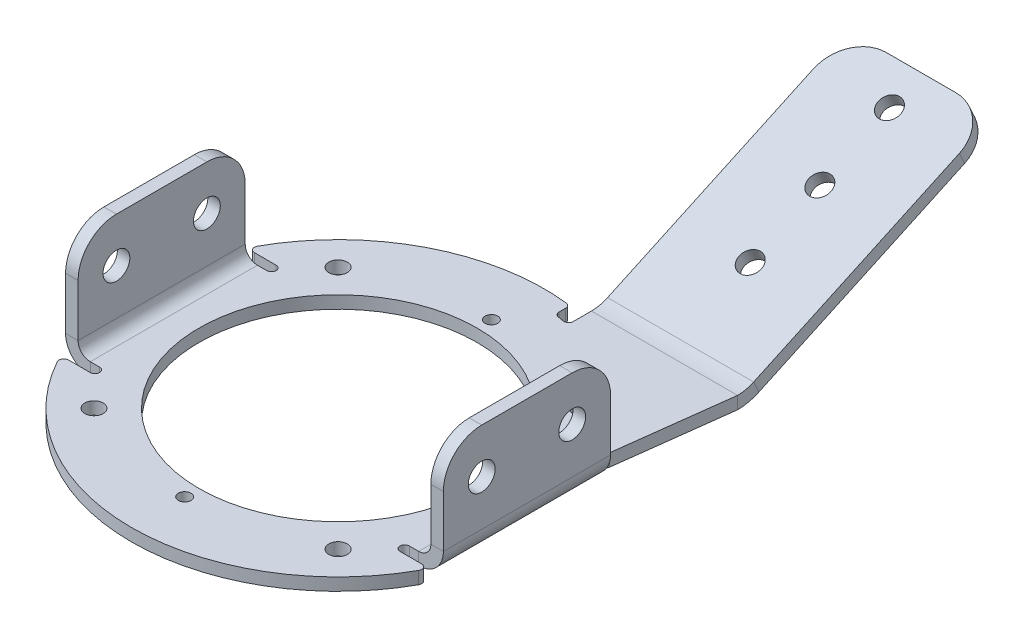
ISO-10303-21;
HEADER;
FILE_DESCRIPTION(('STEP AP214'),'2;1');
FILE_NAME('part.step','',(''),(''),'','','');
FILE_SCHEMA(('AUTOMOTIVE_DESIGN { 1 0 10303 214 1 1 1 1 }'));
ENDSEC;
DATA;
#1=APPLICATION_CONTEXT('core data for automotive mechanical design processes');
#2=APPLICATION_PROTOCOL_DEFINITION('international standard','automotive_design',2000,#1);
#3=PRODUCT_CONTEXT('',#1,'mechanical');
#4=PRODUCT('Part','Part','',(#3));
#5=PRODUCT_RELATED_PRODUCT_CATEGORY('part','',(#4));
#6=PRODUCT_DEFINITION_FORMATION('','',#4);
#7=PRODUCT_DEFINITION_CONTEXT('part definition',#1,'design');
#8=PRODUCT_DEFINITION('design','',#6,#7);
#9=PRODUCT_DEFINITION_SHAPE('','',#8);
#10=(LENGTH_UNIT() NAMED_UNIT(*) SI_UNIT(.MILLI.,.METRE.));
#11=(NAMED_UNIT(*) PLANE_ANGLE_UNIT() SI_UNIT($,.RADIAN.));
#12=(NAMED_UNIT(*) SI_UNIT($,.STERADIAN.) SOLID_ANGLE_UNIT());
#13=UNCERTAINTY_MEASURE_WITH_UNIT(LENGTH_MEASURE(1.E-05),#10,'distance_accuracy_value','');
#14=(GEOMETRIC_REPRESENTATION_CONTEXT(3) GLOBAL_UNCERTAINTY_ASSIGNED_CONTEXT((#13)) GLOBAL_UNIT_ASSIGNED_CONTEXT((#10,
#11,#12)) REPRESENTATION_CONTEXT('',''));
#15=CARTESIAN_POINT('',(0.,0.,0.));
#16=DIRECTION('',(0.,0.,1.));
#17=DIRECTION('',(1.,0.,0.));
#18=AXIS2_PLACEMENT_3D('',#15,#16,#17);
#19=CARTESIAN_POINT('',(0.,3.175,0.));
#20=DIRECTION('',(0.,1.,0.));
#21=DIRECTION('',(0.,0.,1.));
#22=AXIS2_PLACEMENT_3D('',#19,#20,#21);
#23=PLANE('',#22);
#24=CARTESIAN_POINT('',(-31.8198051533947,3.175,-31.8198051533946));
#25=DIRECTION('',(0.,1.,0.));
#26=DIRECTION('',(0.,0.,1.));
#27=AXIS2_PLACEMENT_3D('',#24,#25,#26);
#28=CIRCLE('',#27,2.4);
#29=CARTESIAN_POINT('',(-31.8198051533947,3.175,-29.4198051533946));
#30=VERTEX_POINT('',#29);
#31=EDGE_CURVE('E718',#30,#30,#28,.T.);
#32=ORIENTED_EDGE('',*,*,#31,.F.);
#33=EDGE_LOOP('',(#32));
#34=FACE_BOUND('',#33,.T.);
#35=CARTESIAN_POINT('',(-31.8198051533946,3.175,31.8198051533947));
#36=DIRECTION('',(0.,1.,0.));
#37=DIRECTION('',(0.,0.,1.));
#38=AXIS2_PLACEMENT_3D('',#35,#36,#37);
#39=CIRCLE('',#38,2.4);
#40=CARTESIAN_POINT('',(-31.8198051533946,3.175,34.2198051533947));
#41=VERTEX_POINT('',#40);
#42=EDGE_CURVE('E721',#41,#41,#39,.T.);
#43=ORIENTED_EDGE('',*,*,#42,.F.);
#44=EDGE_LOOP('',(#43));
#45=FACE_BOUND('',#44,.T.);
#46=CARTESIAN_POINT('',(31.8198051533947,3.175,31.8198051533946));
#47=DIRECTION('',(0.,1.,0.));
#48=DIRECTION('',(0.,0.,1.));
#49=AXIS2_PLACEMENT_3D('',#46,#47,#48);
#50=CIRCLE('',#49,2.4);
#51=CARTESIAN_POINT('',(31.8198051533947,3.175,34.2198051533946));
#52=VERTEX_POINT('',#51);
#53=EDGE_CURVE('E724',#52,#52,#50,.T.);
#54=ORIENTED_EDGE('',*,*,#53,.F.);
#55=EDGE_LOOP('',(#54));
#56=FACE_BOUND('',#55,.T.);
#57=CARTESIAN_POINT('',(0.,3.175,40.));
#58=DIRECTION('',(0.,1.,0.));
#59=DIRECTION('',(0.,0.,1.));
#60=AXIS2_PLACEMENT_3D('',#57,#58,#59);
#61=CIRCLE('',#60,1.65);
#62=CARTESIAN_POINT('',(0.,3.175,41.65));
#63=VERTEX_POINT('',#62);
#64=EDGE_CURVE('E727',#63,#63,#61,.T.);
#65=ORIENTED_EDGE('',*,*,#64,.F.);
#66=EDGE_LOOP('',(#65));
#67=FACE_BOUND('',#66,.T.);
#68=CARTESIAN_POINT('',(31.8198051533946,3.175,-31.8198051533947));
#69=DIRECTION('',(0.,1.,0.));
#70=DIRECTION('',(0.,0.,1.));
#71=AXIS2_PLACEMENT_3D('',#68,#69,#70);
#72=CIRCLE('',#71,2.4);
#73=CARTESIAN_POINT('',(31.8198051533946,3.175,-29.4198051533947));
#74=VERTEX_POINT('',#73);
#75=EDGE_CURVE('E730',#74,#74,#72,.T.);
#76=ORIENTED_EDGE('',*,*,#75,.F.);
#77=EDGE_LOOP('',(#76));
#78=FACE_BOUND('',#77,.T.);
#79=CARTESIAN_POINT('',(0.,3.175,-40.));
#80=DIRECTION('',(0.,1.,0.));
#81=DIRECTION('',(0.,0.,1.));
#82=AXIS2_PLACEMENT_3D('',#79,#80,#81);
#83=CIRCLE('',#82,1.65);
#84=CARTESIAN_POINT('',(0.,3.175,-38.35));
#85=VERTEX_POINT('',#84);
#86=EDGE_CURVE('E733',#85,#85,#83,.T.);
#87=ORIENTED_EDGE('',*,*,#86,.F.);
#88=EDGE_LOOP('',(#87));
#89=FACE_BOUND('',#88,.T.);
#90=CARTESIAN_POINT('',(0.,3.175,0.));
#91=DIRECTION('',(0.,1.,0.));
#92=DIRECTION('',(0.,0.,1.));
#93=AXIS2_PLACEMENT_3D('',#90,#91,#92);
#94=CIRCLE('',#93,36.25);
#95=CARTESIAN_POINT('',(0.,3.175,36.25));
#96=VERTEX_POINT('',#95);
#97=EDGE_CURVE('E736',#96,#96,#94,.T.);
#98=ORIENTED_EDGE('',*,*,#97,.F.);
#99=EDGE_LOOP('',(#98));
#100=FACE_BOUND('',#99,.T.);
#101=DIRECTION('',(1.,0.,0.));
#102=VECTOR('',#101,1.);
#103=CARTESIAN_POINT('',(0.,3.175,-24.2944947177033));
#104=LINE('',#103,#102);
#105=CARTESIAN_POINT('',(40.6907181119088,3.175,-24.2944947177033));
#106=VERTEX_POINT('',#105);
#107=CARTESIAN_POINT('',(44.2116539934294,3.175,-24.2944947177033));
#108=VERTEX_POINT('',#107);
#109=EDGE_CURVE('E490',#106,#108,#104,.T.);
#110=ORIENTED_EDGE('',*,*,#109,.T.);
#111=CARTESIAN_POINT('',(44.2116539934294,3.175,-25.5444947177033));
#112=DIRECTION('',(0.,1.,0.));
#113=DIRECTION('',(0.,0.,1.));
#114=AXIS2_PLACEMENT_3D('',#111,#112,#113);
#115=CIRCLE('',#114,1.25);
#116=CARTESIAN_POINT('',(45.4518892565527,3.175,-25.388557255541));
#117=VERTEX_POINT('',#116);
#118=EDGE_CURVE('E858',#108,#117,#115,.T.);
#119=ORIENTED_EDGE('',*,*,#118,.T.);
#120=DIRECTION('',(0.124749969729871,0.,-0.992188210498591));
#121=VECTOR('',#120,1.);
#122=CARTESIAN_POINT('',(41.6020616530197,3.175,5.23071719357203));
#123=LINE('',#122,#121);
#124=CARTESIAN_POINT('',(49.175,3.175,-55.));
#125=VERTEX_POINT('',#124);
#126=EDGE_CURVE('E713',#117,#125,#123,.T.);
#127=ORIENTED_EDGE('',*,*,#126,.T.);
#128=DIRECTION('',(1.,0.,0.));
#129=VECTOR('',#128,1.);
#130=CARTESIAN_POINT('',(0.,3.175,-55.));
#131=LINE('',#130,#129);
#132=CARTESIAN_POINT('',(11.075,3.175,-55.));
#133=VERTEX_POINT('',#132);
#134=EDGE_CURVE('E715',#133,#125,#131,.T.);
#135=ORIENTED_EDGE('',*,*,#134,.F.);
#136=DIRECTION('',(0.,0.,1.));
#137=VECTOR('',#136,1.);
#138=CARTESIAN_POINT('',(11.075,3.175,0.));
#139=LINE('',#138,#137);
#140=CARTESIAN_POINT('',(11.075,3.175,-50.2994222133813));
#141=VERTEX_POINT('',#140);
#142=EDGE_CURVE('E706',#133,#141,#139,.T.);
#143=ORIENTED_EDGE('',*,*,#142,.T.);
#144=CARTESIAN_POINT('',(9.825,3.175,-50.2994222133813));
#145=DIRECTION('',(0.,1.,0.));
#146=DIRECTION('',(0.,0.,1.));
#147=AXIS2_PLACEMENT_3D('',#144,#145,#146);
#148=CIRCLE('',#147,1.25);
#149=CARTESIAN_POINT('',(9.58536585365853,3.175,-49.0726070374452));
#150=VERTEX_POINT('',#149);
#151=EDGE_CURVE('E475',#141,#150,#148,.F.);
#152=ORIENTED_EDGE('',*,*,#151,.T.);
#153=CARTESIAN_POINT('',(0.,3.175,0.));
#154=DIRECTION('',(0.,1.,0.));
#155=DIRECTION('',(0.,0.,1.));
#156=AXIS2_PLACEMENT_3D('',#153,#154,#155);
#157=CIRCLE('',#156,50.);
#158=CARTESIAN_POINT('',(8.12195121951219,3.175,-49.3359291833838));
#159=VERTEX_POINT('',#158);
#160=EDGE_CURVE('E709',#150,#159,#157,.T.);
#161=ORIENTED_EDGE('',*,*,#160,.T.);
#162=CARTESIAN_POINT('',(8.32499999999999,3.175,-50.5693274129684));
#163=DIRECTION('',(0.,1.,0.));
#164=DIRECTION('',(0.,0.,1.));
#165=AXIS2_PLACEMENT_3D('',#162,#163,#164);
#166=CIRCLE('',#165,1.25);
#167=CARTESIAN_POINT('',(7.07499999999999,3.175,-50.5693274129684));
#168=VERTEX_POINT('',#167);
#169=EDGE_CURVE('E13',#159,#168,#166,.F.);
#170=ORIENTED_EDGE('',*,*,#169,.T.);
#171=DIRECTION('',(0.,0.,1.));
#172=VECTOR('',#171,1.);
#173=CARTESIAN_POINT('',(7.07499999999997,3.175,0.));
#174=LINE('',#173,#172);
#175=CARTESIAN_POINT('',(7.07499999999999,3.175,-52.2925849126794));
#176=VERTEX_POINT('',#175);
#177=EDGE_CURVE('E510',#176,#168,#174,.T.);
#178=ORIENTED_EDGE('',*,*,#177,.F.);
#179=CARTESIAN_POINT('',(5.82499999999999,3.175,-52.2925849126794));
#180=DIRECTION('',(0.,1.,0.));
#181=DIRECTION('',(0.,0.,1.));
#182=AXIS2_PLACEMENT_3D('',#179,#180,#181);
#183=CIRCLE('',#182,1.25);
#184=CARTESIAN_POINT('',(5.96338467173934,3.175,-53.5349011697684));
#185=VERTEX_POINT('',#184);
#186=EDGE_CURVE('E856',#176,#185,#183,.T.);
#187=ORIENTED_EDGE('',*,*,#186,.T.);
#188=CARTESIAN_POINT('',(0.,3.175,0.));
#189=DIRECTION('',(0.,1.,0.));
#190=DIRECTION('',(0.,0.,1.));
#191=AXIS2_PLACEMENT_3D('',#188,#189,#190);
#192=CIRCLE('',#191,53.8660152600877);
#193=CARTESIAN_POINT('',(-47.1232002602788,3.175,-26.0950492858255));
#194=VERTEX_POINT('',#193);
#195=EDGE_CURVE('E507',#194,#185,#192,.F.);
#196=ORIENTED_EDGE('',*,*,#195,.F.);
#197=CARTESIAN_POINT('',(-46.02967217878,3.175,-25.4894947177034));
#198=DIRECTION('',(0.,1.,0.));
#199=DIRECTION('',(0.,0.,1.));
#200=AXIS2_PLACEMENT_3D('',#197,#198,#199);
#201=CIRCLE('',#200,1.25);
#202=CARTESIAN_POINT('',(-46.02967217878,3.175,-24.2394947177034));
#203=VERTEX_POINT('',#202);
#204=EDGE_CURVE('E850',#194,#203,#201,.T.);
#205=ORIENTED_EDGE('',*,*,#204,.T.);
#206=DIRECTION('',(-1.,0.,0.));
#207=VECTOR('',#206,1.);
#208=CARTESIAN_POINT('',(-40.375,3.17499999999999,-24.2394947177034));
#209=LINE('',#208,#207);
#210=CARTESIAN_POINT('',(-40.375,3.17499999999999,-24.2394947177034));
#211=VERTEX_POINT('',#210);
#212=EDGE_CURVE('E672',#211,#203,#209,.T.);
#213=ORIENTED_EDGE('',*,*,#212,.F.);
#214=CARTESIAN_POINT('',(-40.375,3.17499999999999,-23.0169947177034));
#215=DIRECTION('',(0.,1.,0.));
#216=DIRECTION('',(0.,0.,1.));
#217=AXIS2_PLACEMENT_3D('',#214,#215,#216);
#218=CIRCLE('',#217,1.2225);
#219=CARTESIAN_POINT('',(-40.375,3.17499999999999,-21.7944947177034));
#220=VERTEX_POINT('',#219);
#221=EDGE_CURVE('E668',#220,#211,#218,.T.);
#222=ORIENTED_EDGE('',*,*,#221,.F.);
#223=DIRECTION('',(1.,0.,0.));
#224=VECTOR('',#223,1.);
#225=CARTESIAN_POINT('',(-42.82,3.17499999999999,-21.7944947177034));
#226=LINE('',#225,#224);
#227=CARTESIAN_POINT('',(-42.82,3.17499999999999,-21.7944947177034));
#228=VERTEX_POINT('',#227);
#229=EDGE_CURVE('E665',#228,#220,#226,.T.);
#230=ORIENTED_EDGE('',*,*,#229,.F.);
#231=DIRECTION('',(0.,0.,1.));
#232=VECTOR('',#231,1.);
#233=CARTESIAN_POINT('',(-42.82,3.17499999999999,21.7944947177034));
#234=LINE('',#233,#232);
#235=CARTESIAN_POINT('',(-42.82,3.17499999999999,21.7944947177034));
#236=VERTEX_POINT('',#235);
#237=EDGE_CURVE('E595',#236,#228,#234,.F.);
#238=ORIENTED_EDGE('',*,*,#237,.F.);
#239=DIRECTION('',(-1.,0.,0.));
#240=VECTOR('',#239,1.);
#241=CARTESIAN_POINT('',(-40.375,3.17499999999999,21.7944947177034));
#242=LINE('',#241,#240);
#243=CARTESIAN_POINT('',(-40.375,3.17499999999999,21.7944947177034));
#244=VERTEX_POINT('',#243);
#245=EDGE_CURVE('E662',#244,#236,#242,.T.);
#246=ORIENTED_EDGE('',*,*,#245,.F.);
#247=CARTESIAN_POINT('',(-40.375,3.17499999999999,23.0169947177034));
#248=DIRECTION('',(0.,1.,0.));
#249=DIRECTION('',(0.,0.,1.));
#250=AXIS2_PLACEMENT_3D('',#247,#248,#249);
#251=CIRCLE('',#250,1.2225);
#252=CARTESIAN_POINT('',(-40.375,3.17499999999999,24.2394947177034));
#253=VERTEX_POINT('',#252);
#254=EDGE_CURVE('E658',#253,#244,#251,.T.);
#255=ORIENTED_EDGE('',*,*,#254,.F.);
#256=DIRECTION('',(1.,0.,0.));
#257=VECTOR('',#256,1.);
#258=CARTESIAN_POINT('',(-43.7315320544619,3.175,24.2394947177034));
#259=LINE('',#258,#257);
#260=CARTESIAN_POINT('',(-46.02967217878,3.175,24.2394947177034));
#261=VERTEX_POINT('',#260);
#262=EDGE_CURVE('E655',#261,#253,#259,.T.);
#263=ORIENTED_EDGE('',*,*,#262,.F.);
#264=CARTESIAN_POINT('',(-46.02967217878,3.175,25.4894947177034));
#265=DIRECTION('',(0.,1.,0.));
#266=DIRECTION('',(0.,0.,1.));
#267=AXIS2_PLACEMENT_3D('',#264,#265,#266);
#268=CIRCLE('',#267,1.25);
#269=CARTESIAN_POINT('',(-47.1232002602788,3.175,26.0950492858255));
#270=VERTEX_POINT('',#269);
#271=EDGE_CURVE('E852',#261,#270,#268,.T.);
#272=ORIENTED_EDGE('',*,*,#271,.T.);
#273=CARTESIAN_POINT('',(0.,3.175,0.));
#274=DIRECTION('',(0.,1.,0.));
#275=DIRECTION('',(0.,0.,1.));
#276=AXIS2_PLACEMENT_3D('',#273,#274,#275);
#277=CIRCLE('',#276,53.8660152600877);
#278=CARTESIAN_POINT('',(47.1232002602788,3.175,26.0950492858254));
#279=VERTEX_POINT('',#278);
#280=EDGE_CURVE('E501',#279,#270,#277,.F.);
#281=ORIENTED_EDGE('',*,*,#280,.F.);
#282=CARTESIAN_POINT('',(46.02967217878,3.175,25.4894947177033));
#283=DIRECTION('',(0.,1.,0.));
#284=DIRECTION('',(0.,0.,1.));
#285=AXIS2_PLACEMENT_3D('',#282,#283,#284);
#286=CIRCLE('',#285,1.25);
#287=CARTESIAN_POINT('',(46.02967217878,3.175,24.2394947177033));
#288=VERTEX_POINT('',#287);
#289=EDGE_CURVE('E854',#279,#288,#286,.T.);
#290=ORIENTED_EDGE('',*,*,#289,.T.);
#291=DIRECTION('',(1.,0.,0.));
#292=VECTOR('',#291,1.);
#293=CARTESIAN_POINT('',(40.375,3.17499999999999,24.2394947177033));
#294=LINE('',#293,#292);
#295=CARTESIAN_POINT('',(40.375,3.175,24.2394947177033));
#296=VERTEX_POINT('',#295);
#297=EDGE_CURVE('E698',#296,#288,#294,.T.);
#298=ORIENTED_EDGE('',*,*,#297,.F.);
#299=CARTESIAN_POINT('',(40.375,3.17499999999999,23.0169947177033));
#300=DIRECTION('',(0.,1.,0.));
#301=DIRECTION('',(0.,0.,1.));
#302=AXIS2_PLACEMENT_3D('',#299,#300,#301);
#303=CIRCLE('',#302,1.2225);
#304=CARTESIAN_POINT('',(40.375,3.175,21.7944947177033));
#305=VERTEX_POINT('',#304);
#306=EDGE_CURVE('E694',#305,#296,#303,.T.);
#307=ORIENTED_EDGE('',*,*,#306,.F.);
#308=DIRECTION('',(-1.,0.,0.));
#309=VECTOR('',#308,1.);
#310=CARTESIAN_POINT('',(42.82,3.17499999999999,21.7944947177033));
#311=LINE('',#310,#309);
#312=CARTESIAN_POINT('',(42.82,3.175,21.7944947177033));
#313=VERTEX_POINT('',#312);
#314=EDGE_CURVE('E691',#313,#305,#311,.T.);
#315=ORIENTED_EDGE('',*,*,#314,.F.);
#316=DIRECTION('',(0.,0.,-1.));
#317=VECTOR('',#316,1.);
#318=CARTESIAN_POINT('',(42.82,3.17499999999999,-21.7944947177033));
#319=LINE('',#318,#317);
#320=CARTESIAN_POINT('',(42.82,3.175,-21.7944947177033));
#321=VERTEX_POINT('',#320);
#322=EDGE_CURVE('E645',#321,#313,#319,.F.);
#323=ORIENTED_EDGE('',*,*,#322,.F.);
#324=DIRECTION('',(1.,0.,0.));
#325=VECTOR('',#324,1.);
#326=CARTESIAN_POINT('',(40.375,3.17499999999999,-21.7944947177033));
#327=LINE('',#326,#325);
#328=CARTESIAN_POINT('',(40.375,3.175,-21.7944947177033));
#329=VERTEX_POINT('',#328);
#330=EDGE_CURVE('E688',#329,#321,#327,.T.);
#331=ORIENTED_EDGE('',*,*,#330,.F.);
#332=CARTESIAN_POINT('',(40.375,3.17499999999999,-23.0169947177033));
#333=DIRECTION('',(0.,1.,0.));
#334=DIRECTION('',(0.,0.,1.));
#335=AXIS2_PLACEMENT_3D('',#332,#333,#334);
#336=CIRCLE('',#335,1.2225);
#337=CARTESIAN_POINT('',(40.32,3.17499999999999,-24.2382568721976));
#338=VERTEX_POINT('',#337);
#339=EDGE_CURVE('E685',#338,#329,#336,.T.);
#340=ORIENTED_EDGE('',*,*,#339,.F.);
#341=CARTESIAN_POINT('',(40.6907181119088,3.175,-23.0444947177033));
#342=DIRECTION('',(0.,1.,0.));
#343=DIRECTION('',(0.,0.,1.));
#344=AXIS2_PLACEMENT_3D('',#341,#342,#343);
#345=CIRCLE('',#344,1.25);
#346=EDGE_CURVE('E476',#338,#106,#345,.F.);
#347=ORIENTED_EDGE('',*,*,#346,.T.);
#348=EDGE_LOOP('',(#110,#119,#127,#135,#143,#152,#161,#170,#178,#187,#196,#205,#213,#222,#230,
#238,#246,#255,#263,#272,#281,#290,#298,#307,#315,#323,#331,#340,#347));
#349=FACE_BOUND('',#348,.T.);
#350=ADVANCED_FACE('F164',(#34,#45,#56,#67,#78,#89,#100,#349),#23,.T.);
#351=CARTESIAN_POINT('',(0.,-0.085,0.));
#352=DIRECTION('',(0.,1.,0.));
#353=DIRECTION('',(0.,0.,1.));
#354=AXIS2_PLACEMENT_3D('',#351,#352,#353);
#355=PLANE('',#354);
#356=CARTESIAN_POINT('',(0.,-0.085,0.));
#357=DIRECTION('',(0.,1.,0.));
#358=DIRECTION('',(0.,0.,1.));
#359=AXIS2_PLACEMENT_3D('',#356,#357,#358);
#360=CIRCLE('',#359,36.25);
#361=CARTESIAN_POINT('',(0.,-0.085,36.25));
#362=VERTEX_POINT('',#361);
#363=EDGE_CURVE('E710',#362,#362,#360,.T.);
#364=ORIENTED_EDGE('',*,*,#363,.T.);
#365=EDGE_LOOP('',(#364));
#366=FACE_BOUND('',#365,.T.);
#367=CARTESIAN_POINT('',(0.,-0.085,-40.));
#368=DIRECTION('',(0.,1.,0.));
#369=DIRECTION('',(0.,0.,1.));
#370=AXIS2_PLACEMENT_3D('',#367,#368,#369);
#371=CIRCLE('',#370,1.65);
#372=CARTESIAN_POINT('',(0.,-0.085,-38.35));
#373=VERTEX_POINT('',#372);
#374=EDGE_CURVE('E763',#373,#373,#371,.T.);
#375=ORIENTED_EDGE('',*,*,#374,.T.);
#376=EDGE_LOOP('',(#375));
#377=FACE_BOUND('',#376,.T.);
#378=CARTESIAN_POINT('',(31.8198051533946,-0.085,-31.8198051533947));
#379=DIRECTION('',(0.,1.,0.));
#380=DIRECTION('',(0.,0.,1.));
#381=AXIS2_PLACEMENT_3D('',#378,#379,#380);
#382=CIRCLE('',#381,2.4);
#383=CARTESIAN_POINT('',(31.8198051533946,-0.085,-29.4198051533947));
#384=VERTEX_POINT('',#383);
#385=EDGE_CURVE('E760',#384,#384,#382,.T.);
#386=ORIENTED_EDGE('',*,*,#385,.T.);
#387=EDGE_LOOP('',(#386));
#388=FACE_BOUND('',#387,.T.);
#389=CARTESIAN_POINT('',(0.,-0.085,40.));
#390=DIRECTION('',(0.,1.,0.));
#391=DIRECTION('',(0.,0.,1.));
#392=AXIS2_PLACEMENT_3D('',#389,#390,#391);
#393=CIRCLE('',#392,1.65);
#394=CARTESIAN_POINT('',(0.,-0.085,41.65));
#395=VERTEX_POINT('',#394);
#396=EDGE_CURVE('E757',#395,#395,#393,.T.);
#397=ORIENTED_EDGE('',*,*,#396,.T.);
#398=EDGE_LOOP('',(#397));
#399=FACE_BOUND('',#398,.T.);
#400=CARTESIAN_POINT('',(31.8198051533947,-0.085,31.8198051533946));
#401=DIRECTION('',(0.,1.,0.));
#402=DIRECTION('',(0.,0.,1.));
#403=AXIS2_PLACEMENT_3D('',#400,#401,#402);
#404=CIRCLE('',#403,2.4);
#405=CARTESIAN_POINT('',(31.8198051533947,-0.085,34.2198051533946));
#406=VERTEX_POINT('',#405);
#407=EDGE_CURVE('E754',#406,#406,#404,.T.);
#408=ORIENTED_EDGE('',*,*,#407,.T.);
#409=EDGE_LOOP('',(#408));
#410=FACE_BOUND('',#409,.T.);
#411=CARTESIAN_POINT('',(-31.8198051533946,-0.085,31.8198051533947));
#412=DIRECTION('',(0.,1.,0.));
#413=DIRECTION('',(0.,0.,1.));
#414=AXIS2_PLACEMENT_3D('',#411,#412,#413);
#415=CIRCLE('',#414,2.4);
#416=CARTESIAN_POINT('',(-31.8198051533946,-0.085,34.2198051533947));
#417=VERTEX_POINT('',#416);
#418=EDGE_CURVE('E751',#417,#417,#415,.T.);
#419=ORIENTED_EDGE('',*,*,#418,.T.);
#420=EDGE_LOOP('',(#419));
#421=FACE_BOUND('',#420,.T.);
#422=CARTESIAN_POINT('',(-31.8198051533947,-0.085,-31.8198051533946));
#423=DIRECTION('',(0.,1.,0.));
#424=DIRECTION('',(0.,0.,1.));
#425=AXIS2_PLACEMENT_3D('',#422,#423,#424);
#426=CIRCLE('',#425,2.4);
#427=CARTESIAN_POINT('',(-31.8198051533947,-0.085,-29.4198051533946));
#428=VERTEX_POINT('',#427);
#429=EDGE_CURVE('E745',#428,#428,#426,.T.);
#430=ORIENTED_EDGE('',*,*,#429,.T.);
#431=EDGE_LOOP('',(#430));
#432=FACE_BOUND('',#431,.T.);
#433=DIRECTION('',(0.124749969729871,0.,-0.992188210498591));
#434=VECTOR('',#433,1.);
#435=CARTESIAN_POINT('',(41.6020616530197,-0.085,5.23071719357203));
#436=LINE('',#435,#434);
#437=CARTESIAN_POINT('',(45.4518892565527,-0.085,-25.388557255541));
#438=VERTEX_POINT('',#437);
#439=CARTESIAN_POINT('',(49.175,-0.085,-55.));
#440=VERTEX_POINT('',#439);
#441=EDGE_CURVE('E746',#438,#440,#436,.T.);
#442=ORIENTED_EDGE('',*,*,#441,.F.);
#443=CARTESIAN_POINT('',(44.2116539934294,-0.085,-25.5444947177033));
#444=DIRECTION('',(0.,1.,0.));
#445=DIRECTION('',(0.,0.,1.));
#446=AXIS2_PLACEMENT_3D('',#443,#444,#445);
#447=CIRCLE('',#446,1.25);
#448=CARTESIAN_POINT('',(44.2116539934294,-0.0850000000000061,-24.2944947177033));
#449=VERTEX_POINT('',#448);
#450=EDGE_CURVE('E870',#438,#449,#447,.F.);
#451=ORIENTED_EDGE('',*,*,#450,.T.);
#452=DIRECTION('',(1.,0.,0.));
#453=VECTOR('',#452,1.);
#454=CARTESIAN_POINT('',(0.,-0.0850000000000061,-24.2944947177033));
#455=LINE('',#454,#453);
#456=CARTESIAN_POINT('',(40.6907181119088,-0.0850000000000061,-24.2944947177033));
#457=VERTEX_POINT('',#456);
#458=EDGE_CURVE('E471',#457,#449,#455,.T.);
#459=ORIENTED_EDGE('',*,*,#458,.F.);
#460=CARTESIAN_POINT('',(40.6907181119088,-0.085,-23.0444947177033));
#461=DIRECTION('',(0.,1.,0.));
#462=DIRECTION('',(0.,0.,1.));
#463=AXIS2_PLACEMENT_3D('',#460,#461,#462);
#464=CIRCLE('',#463,1.25);
#465=CARTESIAN_POINT('',(40.32,-0.0850000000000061,-24.2382568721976));
#466=VERTEX_POINT('',#465);
#467=EDGE_CURVE('E463',#457,#466,#464,.T.);
#468=ORIENTED_EDGE('',*,*,#467,.T.);
#469=CARTESIAN_POINT('',(40.375,-0.085,-23.0169947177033));
#470=DIRECTION('',(0.,1.,0.));
#471=DIRECTION('',(0.,0.,1.));
#472=AXIS2_PLACEMENT_3D('',#469,#470,#471);
#473=CIRCLE('',#472,1.2225);
#474=CARTESIAN_POINT('',(40.375,-0.085,-21.7944947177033));
#475=VERTEX_POINT('',#474);
#476=EDGE_CURVE('E468',#475,#466,#473,.F.);
#477=ORIENTED_EDGE('',*,*,#476,.F.);
#478=DIRECTION('',(-1.,0.,0.));
#479=VECTOR('',#478,1.);
#480=CARTESIAN_POINT('',(0.,-0.085,-21.7944947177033));
#481=LINE('',#480,#479);
#482=CARTESIAN_POINT('',(42.82,-0.0850000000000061,-21.7944947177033));
#483=VERTEX_POINT('',#482);
#484=EDGE_CURVE('E487',#483,#475,#481,.T.);
#485=ORIENTED_EDGE('',*,*,#484,.F.);
#486=DIRECTION('',(0.,0.,-1.));
#487=VECTOR('',#486,1.);
#488=CARTESIAN_POINT('',(42.82,-0.0850000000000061,-21.7944947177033));
#489=LINE('',#488,#487);
#490=CARTESIAN_POINT('',(42.82,-0.085,21.7944947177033));
#491=VERTEX_POINT('',#490);
#492=EDGE_CURVE('E633',#483,#491,#489,.F.);
#493=ORIENTED_EDGE('',*,*,#492,.T.);
#494=DIRECTION('',(1.,0.,0.));
#495=VECTOR('',#494,1.);
#496=CARTESIAN_POINT('',(0.,-0.085,21.7944947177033));
#497=LINE('',#496,#495);
#498=CARTESIAN_POINT('',(40.375,-0.085,21.7944947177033));
#499=VERTEX_POINT('',#498);
#500=EDGE_CURVE('E777',#499,#491,#497,.T.);
#501=ORIENTED_EDGE('',*,*,#500,.F.);
#502=CARTESIAN_POINT('',(40.375,-0.085,23.0169947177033));
#503=DIRECTION('',(0.,1.,0.));
#504=DIRECTION('',(0.,0.,1.));
#505=AXIS2_PLACEMENT_3D('',#502,#503,#504);
#506=CIRCLE('',#505,1.2225);
#507=CARTESIAN_POINT('',(40.375,-0.085,24.2394947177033));
#508=VERTEX_POINT('',#507);
#509=EDGE_CURVE('E774',#508,#499,#506,.F.);
#510=ORIENTED_EDGE('',*,*,#509,.F.);
#511=DIRECTION('',(-1.,0.,0.));
#512=VECTOR('',#511,1.);
#513=CARTESIAN_POINT('',(0.,-0.085,24.2394947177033));
#514=LINE('',#513,#512);
#515=CARTESIAN_POINT('',(46.02967217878,-0.085,24.2394947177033));
#516=VERTEX_POINT('',#515);
#517=EDGE_CURVE('E772',#516,#508,#514,.T.);
#518=ORIENTED_EDGE('',*,*,#517,.F.);
#519=CARTESIAN_POINT('',(46.02967217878,-0.0850000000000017,25.4894947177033));
#520=DIRECTION('',(0.,1.,0.));
#521=DIRECTION('',(0.,0.,1.));
#522=AXIS2_PLACEMENT_3D('',#519,#520,#521);
#523=CIRCLE('',#522,1.25);
#524=CARTESIAN_POINT('',(47.1232002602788,-0.085,26.0950492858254));
#525=VERTEX_POINT('',#524);
#526=EDGE_CURVE('E866',#516,#525,#523,.F.);
#527=ORIENTED_EDGE('',*,*,#526,.T.);
#528=CARTESIAN_POINT('',(0.,-0.085,0.));
#529=DIRECTION('',(0.,-1.,0.));
#530=DIRECTION('',(0.,0.,-1.));
#531=AXIS2_PLACEMENT_3D('',#528,#529,#530);
#532=CIRCLE('',#531,53.8660152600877);
#533=CARTESIAN_POINT('',(-47.1232002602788,-0.085,26.0950492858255));
#534=VERTEX_POINT('',#533);
#535=EDGE_CURVE('E493',#525,#534,#532,.T.);
#536=ORIENTED_EDGE('',*,*,#535,.T.);
#537=CARTESIAN_POINT('',(-46.02967217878,-0.0850000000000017,25.4894947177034));
#538=DIRECTION('',(0.,1.,0.));
#539=DIRECTION('',(0.,0.,1.));
#540=AXIS2_PLACEMENT_3D('',#537,#538,#539);
#541=CIRCLE('',#540,1.25);
#542=CARTESIAN_POINT('',(-46.02967217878,-0.085,24.2394947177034));
#543=VERTEX_POINT('',#542);
#544=EDGE_CURVE('E864',#534,#543,#541,.F.);
#545=ORIENTED_EDGE('',*,*,#544,.T.);
#546=DIRECTION('',(-1.,0.,0.));
#547=VECTOR('',#546,1.);
#548=CARTESIAN_POINT('',(0.,-0.085,24.2394947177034));
#549=LINE('',#548,#547);
#550=CARTESIAN_POINT('',(-40.375,-0.085,24.2394947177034));
#551=VERTEX_POINT('',#550);
#552=EDGE_CURVE('E788',#551,#543,#549,.T.);
#553=ORIENTED_EDGE('',*,*,#552,.F.);
#554=CARTESIAN_POINT('',(-40.375,-0.085,23.0169947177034));
#555=DIRECTION('',(0.,1.,0.));
#556=DIRECTION('',(0.,0.,1.));
#557=AXIS2_PLACEMENT_3D('',#554,#555,#556);
#558=CIRCLE('',#557,1.2225);
#559=CARTESIAN_POINT('',(-40.375,-0.085,21.7944947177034));
#560=VERTEX_POINT('',#559);
#561=EDGE_CURVE('E786',#560,#551,#558,.F.);
#562=ORIENTED_EDGE('',*,*,#561,.F.);
#563=DIRECTION('',(1.,0.,0.));
#564=VECTOR('',#563,1.);
#565=CARTESIAN_POINT('',(0.,-0.085,21.7944947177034));
#566=LINE('',#565,#564);
#567=CARTESIAN_POINT('',(-42.82,-0.0850000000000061,21.7944947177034));
#568=VERTEX_POINT('',#567);
#569=EDGE_CURVE('E784',#568,#560,#566,.T.);
#570=ORIENTED_EDGE('',*,*,#569,.F.);
#571=DIRECTION('',(0.,0.,1.));
#572=VECTOR('',#571,1.);
#573=CARTESIAN_POINT('',(-42.82,-0.0850000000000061,21.7944947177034));
#574=LINE('',#573,#572);
#575=CARTESIAN_POINT('',(-42.82,-0.085,-21.7944947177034));
#576=VERTEX_POINT('',#575);
#577=EDGE_CURVE('E582',#568,#576,#574,.F.);
#578=ORIENTED_EDGE('',*,*,#577,.T.);
#579=DIRECTION('',(-1.,0.,0.));
#580=VECTOR('',#579,1.);
#581=CARTESIAN_POINT('',(0.,-0.085,-21.7944947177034));
#582=LINE('',#581,#580);
#583=CARTESIAN_POINT('',(-40.375,-0.085,-21.7944947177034));
#584=VERTEX_POINT('',#583);
#585=EDGE_CURVE('E782',#584,#576,#582,.T.);
#586=ORIENTED_EDGE('',*,*,#585,.F.);
#587=CARTESIAN_POINT('',(-40.375,-0.085,-23.0169947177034));
#588=DIRECTION('',(0.,1.,0.));
#589=DIRECTION('',(0.,0.,1.));
#590=AXIS2_PLACEMENT_3D('',#587,#588,#589);
#591=CIRCLE('',#590,1.2225);
#592=CARTESIAN_POINT('',(-40.375,-0.085,-24.2394947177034));
#593=VERTEX_POINT('',#592);
#594=EDGE_CURVE('E486',#593,#584,#591,.F.);
#595=ORIENTED_EDGE('',*,*,#594,.F.);
#596=DIRECTION('',(1.,0.,0.));
#597=VECTOR('',#596,1.);
#598=CARTESIAN_POINT('',(0.,-0.085,-24.2394947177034));
#599=LINE('',#598,#597);
#600=CARTESIAN_POINT('',(-46.02967217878,-0.085,-24.2394947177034));
#601=VERTEX_POINT('',#600);
#602=EDGE_CURVE('E657',#601,#593,#599,.T.);
#603=ORIENTED_EDGE('',*,*,#602,.F.);
#604=CARTESIAN_POINT('',(-46.02967217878,-0.0850000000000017,-25.4894947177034));
#605=DIRECTION('',(0.,1.,0.));
#606=DIRECTION('',(0.,0.,1.));
#607=AXIS2_PLACEMENT_3D('',#604,#605,#606);
#608=CIRCLE('',#607,1.25);
#609=CARTESIAN_POINT('',(-47.1232002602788,-0.085,-26.0950492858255));
#610=VERTEX_POINT('',#609);
#611=EDGE_CURVE('E862',#601,#610,#608,.F.);
#612=ORIENTED_EDGE('',*,*,#611,.T.);
#613=CARTESIAN_POINT('',(0.,-0.085,0.));
#614=DIRECTION('',(0.,-1.,0.));
#615=DIRECTION('',(0.,0.,-1.));
#616=AXIS2_PLACEMENT_3D('',#613,#614,#615);
#617=CIRCLE('',#616,53.8660152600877);
#618=CARTESIAN_POINT('',(5.96338467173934,-0.085,-53.5349011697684));
#619=VERTEX_POINT('',#618);
#620=EDGE_CURVE('E504',#610,#619,#617,.T.);
#621=ORIENTED_EDGE('',*,*,#620,.T.);
#622=CARTESIAN_POINT('',(5.82499999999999,-0.0850000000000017,-52.2925849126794));
#623=DIRECTION('',(0.,1.,0.));
#624=DIRECTION('',(0.,0.,1.));
#625=AXIS2_PLACEMENT_3D('',#622,#623,#624);
#626=CIRCLE('',#625,1.25);
#627=CARTESIAN_POINT('',(7.07499999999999,-0.085,-52.2925849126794));
#628=VERTEX_POINT('',#627);
#629=EDGE_CURVE('E868',#619,#628,#626,.F.);
#630=ORIENTED_EDGE('',*,*,#629,.T.);
#631=DIRECTION('',(0.,0.,1.));
#632=VECTOR('',#631,1.);
#633=CARTESIAN_POINT('',(7.07499999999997,-0.085,0.));
#634=LINE('',#633,#632);
#635=CARTESIAN_POINT('',(7.07499999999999,-0.085,-50.5693274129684));
#636=VERTEX_POINT('',#635);
#637=EDGE_CURVE('E505',#628,#636,#634,.T.);
#638=ORIENTED_EDGE('',*,*,#637,.T.);
#639=CARTESIAN_POINT('',(8.32499999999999,-0.085,-50.5693274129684));
#640=DIRECTION('',(0.,1.,0.));
#641=DIRECTION('',(0.,0.,1.));
#642=AXIS2_PLACEMENT_3D('',#639,#640,#641);
#643=CIRCLE('',#642,1.25);
#644=CARTESIAN_POINT('',(8.12195121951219,-0.085,-49.3359291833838));
#645=VERTEX_POINT('',#644);
#646=EDGE_CURVE('E173',#636,#645,#643,.T.);
#647=ORIENTED_EDGE('',*,*,#646,.T.);
#648=CARTESIAN_POINT('',(0.,-0.085,0.));
#649=DIRECTION('',(0.,1.,0.));
#650=DIRECTION('',(0.,0.,1.));
#651=AXIS2_PLACEMENT_3D('',#648,#649,#650);
#652=CIRCLE('',#651,50.);
#653=CARTESIAN_POINT('',(9.58536585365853,-0.085,-49.0726070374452));
#654=VERTEX_POINT('',#653);
#655=EDGE_CURVE('E741',#654,#645,#652,.T.);
#656=ORIENTED_EDGE('',*,*,#655,.F.);
#657=CARTESIAN_POINT('',(9.825,-0.085,-50.2994222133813));
#658=DIRECTION('',(0.,1.,0.));
#659=DIRECTION('',(0.,0.,1.));
#660=AXIS2_PLACEMENT_3D('',#657,#658,#659);
#661=CIRCLE('',#660,1.25);
#662=CARTESIAN_POINT('',(11.075,-0.085,-50.2994222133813));
#663=VERTEX_POINT('',#662);
#664=EDGE_CURVE('E181',#654,#663,#661,.T.);
#665=ORIENTED_EDGE('',*,*,#664,.T.);
#666=DIRECTION('',(0.,0.,1.));
#667=VECTOR('',#666,1.);
#668=CARTESIAN_POINT('',(11.075,-0.085,0.));
#669=LINE('',#668,#667);
#670=CARTESIAN_POINT('',(11.075,-0.085,-55.));
#671=VERTEX_POINT('',#670);
#672=EDGE_CURVE('E687',#671,#663,#669,.T.);
#673=ORIENTED_EDGE('',*,*,#672,.F.);
#674=DIRECTION('',(1.,0.,0.));
#675=VECTOR('',#674,1.);
#676=CARTESIAN_POINT('',(0.,-0.085,-55.));
#677=LINE('',#676,#675);
#678=EDGE_CURVE('E742',#671,#440,#677,.T.);
#679=ORIENTED_EDGE('',*,*,#678,.T.);
#680=EDGE_LOOP('',(#442,#451,#459,#468,#477,#485,#493,#501,#510,#518,#527,#536,#545,#553,#562,
#570,#578,#586,#595,#603,#612,#621,#630,#638,#647,#656,#665,#673,#679));
#681=FACE_BOUND('',#680,.T.);
#682=ADVANCED_FACE('F466',(#366,#377,#388,#399,#410,#421,#432,#681),#355,.F.);
#683=CARTESIAN_POINT('',(41.6020616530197,3.175,5.23071719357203));
#684=DIRECTION('',(0.992188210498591,0.,0.124749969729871));
#685=DIRECTION('',(0.124749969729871,0.,-0.992188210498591));
#686=AXIS2_PLACEMENT_3D('',#683,#684,#685);
#687=PLANE('',#686);
#688=ORIENTED_EDGE('',*,*,#126,.F.);
#689=DIRECTION('',(0.,1.,0.));
#690=VECTOR('',#689,1.);
#691=CARTESIAN_POINT('',(45.4518892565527,3.175,-25.388557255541));
#692=LINE('',#691,#690);
#693=EDGE_CURVE('E860',#117,#438,#692,.F.);
#694=ORIENTED_EDGE('',*,*,#693,.T.);
#695=ORIENTED_EDGE('',*,*,#441,.T.);
#696=DIRECTION('',(0.,1.,0.));
#697=VECTOR('',#696,1.);
#698=CARTESIAN_POINT('',(49.175,3.175,-55.));
#699=LINE('',#698,#697);
#700=EDGE_CURVE('E769',#440,#125,#699,.T.);
#701=ORIENTED_EDGE('',*,*,#700,.T.);
#702=EDGE_LOOP('',(#688,#694,#695,#701));
#703=FACE_BOUND('',#702,.T.);
#704=ADVANCED_FACE('F1012',(#703),#687,.T.);
#705=CARTESIAN_POINT('',(40.375,3.17499999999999,-23.0169947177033));
#706=DIRECTION('',(0.,-1.,0.));
#707=DIRECTION('',(0.,0.,-1.));
#708=AXIS2_PLACEMENT_3D('',#705,#706,#707);
#709=CYLINDRICAL_SURFACE('',#708,1.2225);
#710=ORIENTED_EDGE('',*,*,#476,.T.);
#711=DIRECTION('',(0.,1.,0.));
#712=VECTOR('',#711,1.);
#713=CARTESIAN_POINT('',(40.32,-0.0850000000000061,-24.2382568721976));
#714=LINE('',#713,#712);
#715=EDGE_CURVE('E482',#466,#338,#714,.T.);
#716=ORIENTED_EDGE('',*,*,#715,.T.);
#717=ORIENTED_EDGE('',*,*,#339,.T.);
#718=DIRECTION('',(0.,-1.,0.));
#719=VECTOR('',#718,1.);
#720=CARTESIAN_POINT('',(40.375,3.17499999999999,-21.7944947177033));
#721=LINE('',#720,#719);
#722=EDGE_CURVE('E485',#329,#475,#721,.T.);
#723=ORIENTED_EDGE('',*,*,#722,.T.);
#724=EDGE_LOOP('',(#710,#716,#717,#723));
#725=FACE_BOUND('',#724,.T.);
#726=ADVANCED_FACE('F481',(#725),#709,.F.);
#727=CARTESIAN_POINT('',(0.,3.175,0.));
#728=DIRECTION('',(0.,1.,0.));
#729=DIRECTION('',(0.,0.,1.));
#730=AXIS2_PLACEMENT_3D('',#727,#728,#729);
#731=CYLINDRICAL_SURFACE('',#730,50.);
#732=ORIENTED_EDGE('',*,*,#160,.F.);
#733=DIRECTION('',(0.,1.,0.));
#734=VECTOR('',#733,1.);
#735=CARTESIAN_POINT('',(9.58536585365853,3.175,-49.0726070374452));
#736=LINE('',#735,#734);
#737=EDGE_CURVE('E877',#150,#654,#736,.F.);
#738=ORIENTED_EDGE('',*,*,#737,.T.);
#739=ORIENTED_EDGE('',*,*,#655,.T.);
#740=DIRECTION('',(0.,1.,0.));
#741=VECTOR('',#740,1.);
#742=CARTESIAN_POINT('',(8.12195121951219,3.175,-49.3359291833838));
#743=LINE('',#742,#741);
#744=EDGE_CURVE('E875',#645,#159,#743,.T.);
#745=ORIENTED_EDGE('',*,*,#744,.T.);
#746=EDGE_LOOP('',(#732,#738,#739,#745));
#747=FACE_BOUND('',#746,.T.);
#748=ADVANCED_FACE('F1024',(#747),#731,.T.);
#749=CARTESIAN_POINT('',(11.075,3.175,0.));
#750=DIRECTION('',(-1.,0.,0.));
#751=DIRECTION('',(0.,0.,1.));
#752=AXIS2_PLACEMENT_3D('',#749,#750,#751);
#753=PLANE('',#752);
#754=ORIENTED_EDGE('',*,*,#672,.T.);
#755=DIRECTION('',(0.,-1.,0.));
#756=VECTOR('',#755,1.);
#757=CARTESIAN_POINT('',(11.075,3.175,-50.2994222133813));
#758=LINE('',#757,#756);
#759=EDGE_CURVE('E872',#663,#141,#758,.F.);
#760=ORIENTED_EDGE('',*,*,#759,.T.);
#761=ORIENTED_EDGE('',*,*,#142,.F.);
#762=DIRECTION('',(0.,1.,0.));
#763=VECTOR('',#762,1.);
#764=CARTESIAN_POINT('',(11.075,3.175,-55.));
#765=LINE('',#764,#763);
#766=EDGE_CURVE('E739',#671,#133,#765,.T.);
#767=ORIENTED_EDGE('',*,*,#766,.F.);
#768=EDGE_LOOP('',(#754,#760,#761,#767));
#769=FACE_BOUND('',#768,.T.);
#770=ADVANCED_FACE('F1020',(#769),#753,.T.);
#771=CARTESIAN_POINT('',(-31.8198051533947,3.175,-31.8198051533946));
#772=DIRECTION('',(0.,1.,0.));
#773=DIRECTION('',(0.,0.,1.));
#774=AXIS2_PLACEMENT_3D('',#771,#772,#773);
#775=CYLINDRICAL_SURFACE('',#774,2.4);
#776=ORIENTED_EDGE('',*,*,#31,.T.);
#777=EDGE_LOOP('',(#776));
#778=FACE_BOUND('',#777,.T.);
#779=ORIENTED_EDGE('',*,*,#429,.F.);
#780=EDGE_LOOP('',(#779));
#781=FACE_BOUND('',#780,.T.);
#782=ADVANCED_FACE('F1023',(#778,#781),#775,.F.);
#783=CARTESIAN_POINT('',(-31.8198051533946,3.175,31.8198051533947));
#784=DIRECTION('',(0.,1.,0.));
#785=DIRECTION('',(0.,0.,1.));
#786=AXIS2_PLACEMENT_3D('',#783,#784,#785);
#787=CYLINDRICAL_SURFACE('',#786,2.4);
#788=ORIENTED_EDGE('',*,*,#42,.T.);
#789=EDGE_LOOP('',(#788));
#790=FACE_BOUND('',#789,.T.);
#791=ORIENTED_EDGE('',*,*,#418,.F.);
#792=EDGE_LOOP('',(#791));
#793=FACE_BOUND('',#792,.T.);
#794=ADVANCED_FACE('F1034',(#790,#793),#787,.F.);
#795=CARTESIAN_POINT('',(31.8198051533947,3.175,31.8198051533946));
#796=DIRECTION('',(0.,1.,0.));
#797=DIRECTION('',(0.,0.,1.));
#798=AXIS2_PLACEMENT_3D('',#795,#796,#797);
#799=CYLINDRICAL_SURFACE('',#798,2.4);
#800=ORIENTED_EDGE('',*,*,#53,.T.);
#801=EDGE_LOOP('',(#800));
#802=FACE_BOUND('',#801,.T.);
#803=ORIENTED_EDGE('',*,*,#407,.F.);
#804=EDGE_LOOP('',(#803));
#805=FACE_BOUND('',#804,.T.);
#806=ADVANCED_FACE('F1038',(#802,#805),#799,.F.);
#807=CARTESIAN_POINT('',(0.,3.175,40.));
#808=DIRECTION('',(0.,1.,0.));
#809=DIRECTION('',(0.,0.,1.));
#810=AXIS2_PLACEMENT_3D('',#807,#808,#809);
#811=CYLINDRICAL_SURFACE('',#810,1.65);
#812=ORIENTED_EDGE('',*,*,#64,.T.);
#813=EDGE_LOOP('',(#812));
#814=FACE_BOUND('',#813,.T.);
#815=ORIENTED_EDGE('',*,*,#396,.F.);
#816=EDGE_LOOP('',(#815));
#817=FACE_BOUND('',#816,.T.);
#818=ADVANCED_FACE('F1042',(#814,#817),#811,.F.);
#819=CARTESIAN_POINT('',(31.8198051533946,3.175,-31.8198051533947));
#820=DIRECTION('',(0.,1.,0.));
#821=DIRECTION('',(0.,0.,1.));
#822=AXIS2_PLACEMENT_3D('',#819,#820,#821);
#823=CYLINDRICAL_SURFACE('',#822,2.4);
#824=ORIENTED_EDGE('',*,*,#75,.T.);
#825=EDGE_LOOP('',(#824));
#826=FACE_BOUND('',#825,.T.);
#827=ORIENTED_EDGE('',*,*,#385,.F.);
#828=EDGE_LOOP('',(#827));
#829=FACE_BOUND('',#828,.T.);
#830=ADVANCED_FACE('F1046',(#826,#829),#823,.F.);
#831=CARTESIAN_POINT('',(0.,3.175,-40.));
#832=DIRECTION('',(0.,1.,0.));
#833=DIRECTION('',(0.,0.,1.));
#834=AXIS2_PLACEMENT_3D('',#831,#832,#833);
#835=CYLINDRICAL_SURFACE('',#834,1.65);
#836=ORIENTED_EDGE('',*,*,#86,.T.);
#837=EDGE_LOOP('',(#836));
#838=FACE_BOUND('',#837,.T.);
#839=ORIENTED_EDGE('',*,*,#374,.F.);
#840=EDGE_LOOP('',(#839));
#841=FACE_BOUND('',#840,.T.);
#842=ADVANCED_FACE('F1050',(#838,#841),#835,.F.);
#843=CARTESIAN_POINT('',(0.,3.175,0.));
#844=DIRECTION('',(0.,1.,0.));
#845=DIRECTION('',(0.,0.,1.));
#846=AXIS2_PLACEMENT_3D('',#843,#844,#845);
#847=CYLINDRICAL_SURFACE('',#846,36.25);
#848=ORIENTED_EDGE('',*,*,#97,.T.);
#849=EDGE_LOOP('',(#848));
#850=FACE_BOUND('',#849,.T.);
#851=ORIENTED_EDGE('',*,*,#363,.F.);
#852=EDGE_LOOP('',(#851));
#853=FACE_BOUND('',#852,.T.);
#854=ADVANCED_FACE('F1054',(#850,#853),#847,.F.);
#855=CARTESIAN_POINT('',(40.375,3.17499999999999,-21.7944947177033));
#856=DIRECTION('',(0.,0.,-1.));
#857=DIRECTION('',(0.,1.,0.));
#858=AXIS2_PLACEMENT_3D('',#855,#856,#857);
#859=PLANE('',#858);
#860=DIRECTION('',(0.,-1.,0.));
#861=VECTOR('',#860,1.);
#862=CARTESIAN_POINT('',(42.82,3.17499999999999,-21.7944947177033));
#863=LINE('',#862,#861);
#864=EDGE_CURVE('E639',#321,#483,#863,.T.);
#865=ORIENTED_EDGE('',*,*,#864,.T.);
#866=ORIENTED_EDGE('',*,*,#484,.T.);
#867=ORIENTED_EDGE('',*,*,#722,.F.);
#868=ORIENTED_EDGE('',*,*,#330,.T.);
#869=EDGE_LOOP('',(#865,#866,#867,#868));
#870=FACE_BOUND('',#869,.T.);
#871=ADVANCED_FACE('F1057',(#870),#859,.T.);
#872=CARTESIAN_POINT('',(42.82,3.17499999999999,21.7944947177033));
#873=DIRECTION('',(0.,0.,1.));
#874=DIRECTION('',(0.,-1.,0.));
#875=AXIS2_PLACEMENT_3D('',#872,#873,#874);
#876=PLANE('',#875);
#877=DIRECTION('',(0.,-1.,0.));
#878=VECTOR('',#877,1.);
#879=CARTESIAN_POINT('',(40.375,3.17499999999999,21.7944947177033));
#880=LINE('',#879,#878);
#881=EDGE_CURVE('E697',#305,#499,#880,.T.);
#882=ORIENTED_EDGE('',*,*,#881,.T.);
#883=ORIENTED_EDGE('',*,*,#500,.T.);
#884=DIRECTION('',(0.,-1.,0.));
#885=VECTOR('',#884,1.);
#886=CARTESIAN_POINT('',(42.82,3.17499999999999,21.7944947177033));
#887=LINE('',#886,#885);
#888=EDGE_CURVE('E650',#313,#491,#887,.T.);
#889=ORIENTED_EDGE('',*,*,#888,.F.);
#890=ORIENTED_EDGE('',*,*,#314,.T.);
#891=EDGE_LOOP('',(#882,#883,#889,#890));
#892=FACE_BOUND('',#891,.T.);
#893=ADVANCED_FACE('F1128',(#892),#876,.T.);
#894=CARTESIAN_POINT('',(40.375,3.17499999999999,23.0169947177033));
#895=DIRECTION('',(0.,-1.,0.));
#896=DIRECTION('',(0.,0.,-1.));
#897=AXIS2_PLACEMENT_3D('',#894,#895,#896);
#898=CYLINDRICAL_SURFACE('',#897,1.2225);
#899=DIRECTION('',(0.,-1.,0.));
#900=VECTOR('',#899,1.);
#901=CARTESIAN_POINT('',(40.375,3.17499999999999,24.2394947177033));
#902=LINE('',#901,#900);
#903=EDGE_CURVE('E684',#296,#508,#902,.T.);
#904=ORIENTED_EDGE('',*,*,#903,.T.);
#905=ORIENTED_EDGE('',*,*,#509,.T.);
#906=ORIENTED_EDGE('',*,*,#881,.F.);
#907=ORIENTED_EDGE('',*,*,#306,.T.);
#908=EDGE_LOOP('',(#904,#905,#906,#907));
#909=FACE_BOUND('',#908,.T.);
#910=ADVANCED_FACE('F1124',(#909),#898,.F.);
#911=CARTESIAN_POINT('',(40.375,3.17499999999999,24.2394947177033));
#912=DIRECTION('',(0.,0.,-1.));
#913=DIRECTION('',(0.,1.,0.));
#914=AXIS2_PLACEMENT_3D('',#911,#912,#913);
#915=PLANE('',#914);
#916=ORIENTED_EDGE('',*,*,#297,.T.);
#917=DIRECTION('',(0.,-1.,0.));
#918=VECTOR('',#917,1.);
#919=CARTESIAN_POINT('',(46.02967217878,3.17499999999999,24.2394947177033));
#920=LINE('',#919,#918);
#921=EDGE_CURVE('E889',#288,#516,#920,.T.);
#922=ORIENTED_EDGE('',*,*,#921,.T.);
#923=ORIENTED_EDGE('',*,*,#517,.T.);
#924=ORIENTED_EDGE('',*,*,#903,.F.);
#925=EDGE_LOOP('',(#916,#922,#923,#924));
#926=FACE_BOUND('',#925,.T.);
#927=ADVANCED_FACE('F1119',(#926),#915,.T.);
#928=CARTESIAN_POINT('',(-43.7315320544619,3.175,24.2394947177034));
#929=DIRECTION('',(0.,0.,-1.));
#930=DIRECTION('',(0.,1.,0.));
#931=AXIS2_PLACEMENT_3D('',#928,#929,#930);
#932=PLANE('',#931);
#933=ORIENTED_EDGE('',*,*,#552,.T.);
#934=DIRECTION('',(0.,-1.,0.));
#935=VECTOR('',#934,1.);
#936=CARTESIAN_POINT('',(-46.02967217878,3.175,24.2394947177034));
#937=LINE('',#936,#935);
#938=EDGE_CURVE('E897',#543,#261,#937,.F.);
#939=ORIENTED_EDGE('',*,*,#938,.T.);
#940=ORIENTED_EDGE('',*,*,#262,.T.);
#941=DIRECTION('',(0.,-1.,0.));
#942=VECTOR('',#941,1.);
#943=CARTESIAN_POINT('',(-40.375,3.17499999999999,24.2394947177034));
#944=LINE('',#943,#942);
#945=EDGE_CURVE('E661',#253,#551,#944,.T.);
#946=ORIENTED_EDGE('',*,*,#945,.T.);
#947=EDGE_LOOP('',(#933,#939,#940,#946));
#948=FACE_BOUND('',#947,.T.);
#949=ADVANCED_FACE('F1261',(#948),#932,.T.);
#950=CARTESIAN_POINT('',(-40.375,3.17499999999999,23.0169947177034));
#951=DIRECTION('',(0.,-1.,0.));
#952=DIRECTION('',(0.,0.,-1.));
#953=AXIS2_PLACEMENT_3D('',#950,#951,#952);
#954=CYLINDRICAL_SURFACE('',#953,1.2225);
#955=DIRECTION('',(0.,-1.,0.));
#956=VECTOR('',#955,1.);
#957=CARTESIAN_POINT('',(-40.375,3.17499999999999,21.7944947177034));
#958=LINE('',#957,#956);
#959=EDGE_CURVE('E664',#244,#560,#958,.T.);
#960=ORIENTED_EDGE('',*,*,#959,.T.);
#961=ORIENTED_EDGE('',*,*,#561,.T.);
#962=ORIENTED_EDGE('',*,*,#945,.F.);
#963=ORIENTED_EDGE('',*,*,#254,.T.);
#964=EDGE_LOOP('',(#960,#961,#962,#963));
#965=FACE_BOUND('',#964,.T.);
#966=ADVANCED_FACE('F1259',(#965),#954,.F.);
#967=CARTESIAN_POINT('',(-40.375,3.17499999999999,21.7944947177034));
#968=DIRECTION('',(0.,0.,1.));
#969=DIRECTION('',(0.,-1.,0.));
#970=AXIS2_PLACEMENT_3D('',#967,#968,#969);
#971=PLANE('',#970);
#972=DIRECTION('',(0.,-1.,0.));
#973=VECTOR('',#972,1.);
#974=CARTESIAN_POINT('',(-42.82,3.17499999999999,21.7944947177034));
#975=LINE('',#974,#973);
#976=EDGE_CURVE('E589',#236,#568,#975,.T.);
#977=ORIENTED_EDGE('',*,*,#976,.T.);
#978=ORIENTED_EDGE('',*,*,#569,.T.);
#979=ORIENTED_EDGE('',*,*,#959,.F.);
#980=ORIENTED_EDGE('',*,*,#245,.T.);
#981=EDGE_LOOP('',(#977,#978,#979,#980));
#982=FACE_BOUND('',#981,.T.);
#983=ADVANCED_FACE('F1256',(#982),#971,.T.);
#984=CARTESIAN_POINT('',(-42.82,3.17499999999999,-21.7944947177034));
#985=DIRECTION('',(0.,0.,-1.));
#986=DIRECTION('',(0.,1.,0.));
#987=AXIS2_PLACEMENT_3D('',#984,#985,#986);
#988=PLANE('',#987);
#989=DIRECTION('',(0.,-1.,0.));
#990=VECTOR('',#989,1.);
#991=CARTESIAN_POINT('',(-40.375,3.17499999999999,-21.7944947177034));
#992=LINE('',#991,#990);
#993=EDGE_CURVE('E671',#220,#584,#992,.T.);
#994=ORIENTED_EDGE('',*,*,#993,.T.);
#995=ORIENTED_EDGE('',*,*,#585,.T.);
#996=DIRECTION('',(0.,-1.,0.));
#997=VECTOR('',#996,1.);
#998=CARTESIAN_POINT('',(-42.82,3.17499999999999,-21.7944947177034));
#999=LINE('',#998,#997);
#1000=EDGE_CURVE('E600',#228,#576,#999,.T.);
#1001=ORIENTED_EDGE('',*,*,#1000,.F.);
#1002=ORIENTED_EDGE('',*,*,#229,.T.);
#1003=EDGE_LOOP('',(#994,#995,#1001,#1002));
#1004=FACE_BOUND('',#1003,.T.);
#1005=ADVANCED_FACE('F1306',(#1004),#988,.T.);
#1006=CARTESIAN_POINT('',(-40.375,3.17499999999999,-23.0169947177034));
#1007=DIRECTION('',(0.,-1.,0.));
#1008=DIRECTION('',(0.,0.,-1.));
#1009=AXIS2_PLACEMENT_3D('',#1006,#1007,#1008);
#1010=CYLINDRICAL_SURFACE('',#1009,1.2225);
#1011=DIRECTION('',(0.,-1.,0.));
#1012=VECTOR('',#1011,1.);
#1013=CARTESIAN_POINT('',(-40.375,3.17499999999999,-24.2394947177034));
#1014=LINE('',#1013,#1012);
#1015=EDGE_CURVE('E653',#211,#593,#1014,.T.);
#1016=ORIENTED_EDGE('',*,*,#1015,.T.);
#1017=ORIENTED_EDGE('',*,*,#594,.T.);
#1018=ORIENTED_EDGE('',*,*,#993,.F.);
#1019=ORIENTED_EDGE('',*,*,#221,.T.);
#1020=EDGE_LOOP('',(#1016,#1017,#1018,#1019));
#1021=FACE_BOUND('',#1020,.T.);
#1022=ADVANCED_FACE('F1208',(#1021),#1010,.F.);
#1023=CARTESIAN_POINT('',(-40.375,3.17499999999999,-24.2394947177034));
#1024=DIRECTION('',(0.,0.,1.));
#1025=DIRECTION('',(0.,-1.,0.));
#1026=AXIS2_PLACEMENT_3D('',#1023,#1024,#1025);
#1027=PLANE('',#1026);
#1028=ORIENTED_EDGE('',*,*,#212,.T.);
#1029=DIRECTION('',(0.,-1.,0.));
#1030=VECTOR('',#1029,1.);
#1031=CARTESIAN_POINT('',(-46.02967217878,3.17499999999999,-24.2394947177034));
#1032=LINE('',#1031,#1030);
#1033=EDGE_CURVE('E899',#203,#601,#1032,.T.);
#1034=ORIENTED_EDGE('',*,*,#1033,.T.);
#1035=ORIENTED_EDGE('',*,*,#602,.T.);
#1036=ORIENTED_EDGE('',*,*,#1015,.F.);
#1037=EDGE_LOOP('',(#1028,#1034,#1035,#1036));
#1038=FACE_BOUND('',#1037,.T.);
#1039=ADVANCED_FACE('F1204',(#1038),#1027,.T.);
#1040=CARTESIAN_POINT('',(42.82,6.355,21.7944947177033));
#1041=DIRECTION('',(0.,0.,1.));
#1042=DIRECTION('',(1.,0.,0.));
#1043=AXIS2_PLACEMENT_3D('',#1040,#1041,#1042);
#1044=PLANE('',#1043);
#1045=DIRECTION('',(-1.,0.,0.));
#1046=VECTOR('',#1045,1.);
#1047=CARTESIAN_POINT('',(49.26,6.35499999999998,21.7944947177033));
#1048=LINE('',#1047,#1046);
#1049=CARTESIAN_POINT('',(46.,6.35499999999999,21.7944947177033));
#1050=VERTEX_POINT('',#1049);
#1051=CARTESIAN_POINT('',(49.26,6.35499999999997,21.7944947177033));
#1052=VERTEX_POINT('',#1051);
#1053=EDGE_CURVE('E603',#1050,#1052,#1048,.F.);
#1054=ORIENTED_EDGE('',*,*,#1053,.F.);
#1055=CARTESIAN_POINT('',(42.82,6.355,21.7944947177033));
#1056=DIRECTION('',(0.,0.,-1.));
#1057=DIRECTION('',(-1.,0.,0.));
#1058=AXIS2_PLACEMENT_3D('',#1055,#1056,#1057);
#1059=CIRCLE('',#1058,3.18);
#1060=EDGE_CURVE('E642',#313,#1050,#1059,.F.);
#1061=ORIENTED_EDGE('',*,*,#1060,.F.);
#1062=ORIENTED_EDGE('',*,*,#888,.T.);
#1063=CARTESIAN_POINT('',(42.82,6.355,21.7944947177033));
#1064=DIRECTION('',(0.,0.,-1.));
#1065=DIRECTION('',(-1.,0.,0.));
#1066=AXIS2_PLACEMENT_3D('',#1063,#1064,#1065);
#1067=CIRCLE('',#1066,6.44);
#1068=EDGE_CURVE('E635',#491,#1052,#1067,.F.);
#1069=ORIENTED_EDGE('',*,*,#1068,.T.);
#1070=EDGE_LOOP('',(#1054,#1061,#1062,#1069));
#1071=FACE_BOUND('',#1070,.T.);
#1072=ADVANCED_FACE('F1137',(#1071),#1044,.T.);
#1073=CARTESIAN_POINT('',(42.82,6.355,-21.7944947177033));
#1074=DIRECTION('',(0.,0.,1.));
#1075=DIRECTION('',(1.,0.,0.));
#1076=AXIS2_PLACEMENT_3D('',#1073,#1074,#1075);
#1077=PLANE('',#1076);
#1078=CARTESIAN_POINT('',(42.82,6.355,-21.7944947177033));
#1079=DIRECTION('',(0.,0.,-1.));
#1080=DIRECTION('',(-1.,0.,0.));
#1081=AXIS2_PLACEMENT_3D('',#1078,#1079,#1080);
#1082=CIRCLE('',#1081,3.18);
#1083=CARTESIAN_POINT('',(46.,6.35499999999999,-21.7944947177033));
#1084=VERTEX_POINT('',#1083);
#1085=EDGE_CURVE('E608',#1084,#321,#1082,.T.);
#1086=ORIENTED_EDGE('',*,*,#1085,.F.);
#1087=DIRECTION('',(-1.,0.,0.));
#1088=VECTOR('',#1087,1.);
#1089=CARTESIAN_POINT('',(46.,6.35499999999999,-21.7944947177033));
#1090=LINE('',#1089,#1088);
#1091=CARTESIAN_POINT('',(49.26,6.35499999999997,-21.7944947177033));
#1092=VERTEX_POINT('',#1091);
#1093=EDGE_CURVE('E626',#1084,#1092,#1090,.F.);
#1094=ORIENTED_EDGE('',*,*,#1093,.T.);
#1095=CARTESIAN_POINT('',(42.82,6.355,-21.7944947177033));
#1096=DIRECTION('',(0.,0.,-1.));
#1097=DIRECTION('',(-1.,0.,0.));
#1098=AXIS2_PLACEMENT_3D('',#1095,#1096,#1097);
#1099=CIRCLE('',#1098,6.44);
#1100=EDGE_CURVE('E636',#1092,#483,#1099,.T.);
#1101=ORIENTED_EDGE('',*,*,#1100,.T.);
#1102=ORIENTED_EDGE('',*,*,#864,.F.);
#1103=EDGE_LOOP('',(#1086,#1094,#1101,#1102));
#1104=FACE_BOUND('',#1103,.T.);
#1105=ADVANCED_FACE('F1150',(#1104),#1077,.F.);
#1106=CARTESIAN_POINT('',(42.82,6.355,-21.7944947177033));
#1107=DIRECTION('',(0.,0.,-1.));
#1108=DIRECTION('',(1.,0.,0.));
#1109=AXIS2_PLACEMENT_3D('',#1106,#1107,#1108);
#1110=CYLINDRICAL_SURFACE('',#1109,6.44);
#1111=ORIENTED_EDGE('',*,*,#492,.F.);
#1112=ORIENTED_EDGE('',*,*,#1100,.F.);
#1113=DIRECTION('',(0.,0.,-1.));
#1114=VECTOR('',#1113,1.);
#1115=CARTESIAN_POINT('',(49.26,6.35499999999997,21.7944947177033));
#1116=LINE('',#1115,#1114);
#1117=EDGE_CURVE('E623',#1092,#1052,#1116,.F.);
#1118=ORIENTED_EDGE('',*,*,#1117,.T.);
#1119=ORIENTED_EDGE('',*,*,#1068,.F.);
#1120=EDGE_LOOP('',(#1111,#1112,#1118,#1119));
#1121=FACE_BOUND('',#1120,.T.);
#1122=ADVANCED_FACE('F1167',(#1121),#1110,.T.);
#1123=CARTESIAN_POINT('',(42.82,6.355,-21.7944947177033));
#1124=DIRECTION('',(0.,0.,-1.));
#1125=DIRECTION('',(1.,0.,0.));
#1126=AXIS2_PLACEMENT_3D('',#1123,#1124,#1125);
#1127=CYLINDRICAL_SURFACE('',#1126,3.18);
#1128=ORIENTED_EDGE('',*,*,#322,.T.);
#1129=ORIENTED_EDGE('',*,*,#1060,.T.);
#1130=DIRECTION('',(0.,0.,-1.));
#1131=VECTOR('',#1130,1.);
#1132=CARTESIAN_POINT('',(46.,6.35499999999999,21.7944947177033));
#1133=LINE('',#1132,#1131);
#1134=EDGE_CURVE('E629',#1050,#1084,#1133,.T.);
#1135=ORIENTED_EDGE('',*,*,#1134,.T.);
#1136=ORIENTED_EDGE('',*,*,#1085,.T.);
#1137=EDGE_LOOP('',(#1128,#1129,#1135,#1136));
#1138=FACE_BOUND('',#1137,.T.);
#1139=ADVANCED_FACE('F1133',(#1138),#1127,.F.);
#1140=CARTESIAN_POINT('',(49.2600000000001,29.915,-21.7944947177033));
#1141=DIRECTION('',(0.,0.,1.));
#1142=DIRECTION('',(0.,-1.,0.));
#1143=AXIS2_PLACEMENT_3D('',#1140,#1141,#1142);
#1144=PLANE('',#1143);
#1145=DIRECTION('',(0.,-1.,0.));
#1146=VECTOR('',#1145,1.);
#1147=CARTESIAN_POINT('',(46.0000000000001,29.915,-21.7944947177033));
#1148=LINE('',#1147,#1146);
#1149=CARTESIAN_POINT('',(46.0000000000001,19.915,-21.7944947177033));
#1150=VERTEX_POINT('',#1149);
#1151=EDGE_CURVE('E620',#1084,#1150,#1148,.F.);
#1152=ORIENTED_EDGE('',*,*,#1151,.T.);
#1153=DIRECTION('',(-1.,0.,0.));
#1154=VECTOR('',#1153,1.);
#1155=CARTESIAN_POINT('',(49.2600000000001,19.915,-21.7944947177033));
#1156=LINE('',#1155,#1154);
#1157=CARTESIAN_POINT('',(49.2600000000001,19.915,-21.7944947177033));
#1158=VERTEX_POINT('',#1157);
#1159=EDGE_CURVE('E800',#1150,#1158,#1156,.F.);
#1160=ORIENTED_EDGE('',*,*,#1159,.T.);
#1161=DIRECTION('',(0.,1.,0.));
#1162=VECTOR('',#1161,1.);
#1163=CARTESIAN_POINT('',(49.26,-1.66014531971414E-13,-21.7944947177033));
#1164=LINE('',#1163,#1162);
#1165=EDGE_CURVE('E612',#1092,#1158,#1164,.T.);
#1166=ORIENTED_EDGE('',*,*,#1165,.F.);
#1167=ORIENTED_EDGE('',*,*,#1093,.F.);
#1168=EDGE_LOOP('',(#1152,#1160,#1166,#1167));
#1169=FACE_BOUND('',#1168,.T.);
#1170=ADVANCED_FACE('F1154',(#1169),#1144,.F.);
#1171=CARTESIAN_POINT('',(49.26,3.17499999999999,21.7944947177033));
#1172=DIRECTION('',(0.,0.,-1.));
#1173=DIRECTION('',(-1.,0.,0.));
#1174=AXIS2_PLACEMENT_3D('',#1171,#1172,#1173);
#1175=PLANE('',#1174);
#1176=DIRECTION('',(0.,-1.,0.));
#1177=VECTOR('',#1176,1.);
#1178=CARTESIAN_POINT('',(49.26,-1.63186751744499E-13,21.7944947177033));
#1179=LINE('',#1178,#1177);
#1180=CARTESIAN_POINT('',(49.2600000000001,19.915,21.7944947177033));
#1181=VERTEX_POINT('',#1180);
#1182=EDGE_CURVE('E606',#1181,#1052,#1179,.T.);
#1183=ORIENTED_EDGE('',*,*,#1182,.F.);
#1184=DIRECTION('',(-1.,0.,0.));
#1185=VECTOR('',#1184,1.);
#1186=CARTESIAN_POINT('',(49.2600000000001,19.915,21.7944947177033));
#1187=LINE('',#1186,#1185);
#1188=CARTESIAN_POINT('',(46.0000000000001,19.915,21.7944947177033));
#1189=VERTEX_POINT('',#1188);
#1190=EDGE_CURVE('E806',#1181,#1189,#1187,.T.);
#1191=ORIENTED_EDGE('',*,*,#1190,.T.);
#1192=DIRECTION('',(0.,1.,0.));
#1193=VECTOR('',#1192,1.);
#1194=CARTESIAN_POINT('',(46.,3.175,21.7944947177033));
#1195=LINE('',#1194,#1193);
#1196=EDGE_CURVE('E615',#1189,#1050,#1195,.F.);
#1197=ORIENTED_EDGE('',*,*,#1196,.T.);
#1198=ORIENTED_EDGE('',*,*,#1053,.T.);
#1199=EDGE_LOOP('',(#1183,#1191,#1197,#1198));
#1200=FACE_BOUND('',#1199,.T.);
#1201=ADVANCED_FACE('F1140',(#1200),#1175,.F.);
#1202=CARTESIAN_POINT('',(49.26,-1.63186751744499E-13,0.));
#1203=DIRECTION('',(-1.,0.,0.));
#1204=DIRECTION('',(0.,-1.,0.));
#1205=AXIS2_PLACEMENT_3D('',#1202,#1203,#1204);
#1206=PLANE('',#1205);
#1207=CARTESIAN_POINT('',(49.2600000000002,18.2750000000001,-11.7944947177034));
#1208=DIRECTION('',(-1.,0.,0.));
#1209=DIRECTION('',(0.,-1.,0.));
#1210=AXIS2_PLACEMENT_3D('',#1207,#1208,#1209);
#1211=CIRCLE('',#1210,3.5);
#1212=CARTESIAN_POINT('',(49.2600000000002,14.7750000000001,-11.7944947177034));
#1213=VERTEX_POINT('',#1212);
#1214=EDGE_CURVE('E917',#1213,#1213,#1211,.T.);
#1215=ORIENTED_EDGE('',*,*,#1214,.T.);
#1216=EDGE_LOOP('',(#1215));
#1217=FACE_BOUND('',#1216,.T.);
#1218=CARTESIAN_POINT('',(49.2600000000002,18.2750000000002,11.7944947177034));
#1219=DIRECTION('',(-1.,0.,0.));
#1220=DIRECTION('',(0.,-1.,0.));
#1221=AXIS2_PLACEMENT_3D('',#1218,#1219,#1220);
#1222=CIRCLE('',#1221,3.5);
#1223=CARTESIAN_POINT('',(49.2600000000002,14.7750000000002,11.7944947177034));
#1224=VERTEX_POINT('',#1223);
#1225=EDGE_CURVE('E928',#1224,#1224,#1222,.T.);
#1226=ORIENTED_EDGE('',*,*,#1225,.T.);
#1227=EDGE_LOOP('',(#1226));
#1228=FACE_BOUND('',#1227,.T.);
#1229=ORIENTED_EDGE('',*,*,#1165,.T.);
#1230=CARTESIAN_POINT('',(49.2600000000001,19.915,-11.7944947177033));
#1231=DIRECTION('',(-1.,0.,0.));
#1232=DIRECTION('',(0.,-1.,0.));
#1233=AXIS2_PLACEMENT_3D('',#1230,#1231,#1232);
#1234=CIRCLE('',#1233,10.);
#1235=CARTESIAN_POINT('',(49.2600000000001,29.915,-11.7944947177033));
#1236=VERTEX_POINT('',#1235);
#1237=EDGE_CURVE('E804',#1158,#1236,#1234,.F.);
#1238=ORIENTED_EDGE('',*,*,#1237,.T.);
#1239=DIRECTION('',(0.,0.,1.));
#1240=VECTOR('',#1239,1.);
#1241=CARTESIAN_POINT('',(49.2600000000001,29.915,0.));
#1242=LINE('',#1241,#1240);
#1243=CARTESIAN_POINT('',(49.2600000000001,29.915,11.7944947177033));
#1244=VERTEX_POINT('',#1243);
#1245=EDGE_CURVE('E609',#1236,#1244,#1242,.T.);
#1246=ORIENTED_EDGE('',*,*,#1245,.T.);
#1247=CARTESIAN_POINT('',(49.2600000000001,19.915,11.7944947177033));
#1248=DIRECTION('',(-1.,0.,0.));
#1249=DIRECTION('',(0.,-1.,0.));
#1250=AXIS2_PLACEMENT_3D('',#1247,#1248,#1249);
#1251=CIRCLE('',#1250,10.);
#1252=EDGE_CURVE('E802',#1244,#1181,#1251,.F.);
#1253=ORIENTED_EDGE('',*,*,#1252,.T.);
#1254=ORIENTED_EDGE('',*,*,#1182,.T.);
#1255=ORIENTED_EDGE('',*,*,#1117,.F.);
#1256=EDGE_LOOP('',(#1229,#1238,#1246,#1253,#1254,#1255));
#1257=FACE_BOUND('',#1256,.T.);
#1258=ADVANCED_FACE('F1158',(#1217,#1228,#1257),#1206,.F.);
#1259=CARTESIAN_POINT('',(46.,-1.5180452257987E-13,0.));
#1260=DIRECTION('',(-1.,0.,0.));
#1261=DIRECTION('',(0.,-1.,0.));
#1262=AXIS2_PLACEMENT_3D('',#1259,#1260,#1261);
#1263=PLANE('',#1262);
#1264=CARTESIAN_POINT('',(46.0000000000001,18.2750000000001,-11.7944947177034));
#1265=DIRECTION('',(-1.,0.,0.));
#1266=DIRECTION('',(0.,-1.,0.));
#1267=AXIS2_PLACEMENT_3D('',#1264,#1265,#1266);
#1268=CIRCLE('',#1267,3.5);
#1269=CARTESIAN_POINT('',(46.0000000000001,14.7750000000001,-11.7944947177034));
#1270=VERTEX_POINT('',#1269);
#1271=EDGE_CURVE('E936',#1270,#1270,#1268,.T.);
#1272=ORIENTED_EDGE('',*,*,#1271,.F.);
#1273=EDGE_LOOP('',(#1272));
#1274=FACE_BOUND('',#1273,.T.);
#1275=CARTESIAN_POINT('',(46.0000000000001,18.2750000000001,11.7944947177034));
#1276=DIRECTION('',(-1.,0.,0.));
#1277=DIRECTION('',(0.,-1.,0.));
#1278=AXIS2_PLACEMENT_3D('',#1275,#1276,#1277);
#1279=CIRCLE('',#1278,3.5);
#1280=CARTESIAN_POINT('',(46.0000000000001,14.7750000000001,11.7944947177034));
#1281=VERTEX_POINT('',#1280);
#1282=EDGE_CURVE('E916',#1281,#1281,#1279,.T.);
#1283=ORIENTED_EDGE('',*,*,#1282,.F.);
#1284=EDGE_LOOP('',(#1283));
#1285=FACE_BOUND('',#1284,.T.);
#1286=DIRECTION('',(0.,0.,-1.));
#1287=VECTOR('',#1286,1.);
#1288=CARTESIAN_POINT('',(46.0000000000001,29.915,21.7944947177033));
#1289=LINE('',#1288,#1287);
#1290=CARTESIAN_POINT('',(46.0000000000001,29.915,-11.7944947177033));
#1291=VERTEX_POINT('',#1290);
#1292=CARTESIAN_POINT('',(46.0000000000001,29.915,11.7944947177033));
#1293=VERTEX_POINT('',#1292);
#1294=EDGE_CURVE('E617',#1291,#1293,#1289,.F.);
#1295=ORIENTED_EDGE('',*,*,#1294,.F.);
#1296=CARTESIAN_POINT('',(46.0000000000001,19.915,-11.7944947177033));
#1297=DIRECTION('',(-1.,0.,0.));
#1298=DIRECTION('',(0.,-1.,0.));
#1299=AXIS2_PLACEMENT_3D('',#1296,#1297,#1298);
#1300=CIRCLE('',#1299,10.);
#1301=EDGE_CURVE('E798',#1291,#1150,#1300,.T.);
#1302=ORIENTED_EDGE('',*,*,#1301,.T.);
#1303=ORIENTED_EDGE('',*,*,#1151,.F.);
#1304=ORIENTED_EDGE('',*,*,#1134,.F.);
#1305=ORIENTED_EDGE('',*,*,#1196,.F.);
#1306=CARTESIAN_POINT('',(46.0000000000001,19.915,11.7944947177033));
#1307=DIRECTION('',(-1.,0.,0.));
#1308=DIRECTION('',(0.,-1.,0.));
#1309=AXIS2_PLACEMENT_3D('',#1306,#1307,#1308);
#1310=CIRCLE('',#1309,10.);
#1311=EDGE_CURVE('E796',#1189,#1293,#1310,.T.);
#1312=ORIENTED_EDGE('',*,*,#1311,.T.);
#1313=EDGE_LOOP('',(#1295,#1302,#1303,#1304,#1305,#1312));
#1314=FACE_BOUND('',#1313,.T.);
#1315=ADVANCED_FACE('F1145',(#1274,#1285,#1314),#1263,.T.);
#1316=CARTESIAN_POINT('',(49.2600000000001,29.915,21.7944947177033));
#1317=DIRECTION('',(0.,-1.,0.));
#1318=DIRECTION('',(1.,0.,0.));
#1319=AXIS2_PLACEMENT_3D('',#1316,#1317,#1318);
#1320=PLANE('',#1319);
#1321=ORIENTED_EDGE('',*,*,#1245,.F.);
#1322=DIRECTION('',(-1.,0.,0.));
#1323=VECTOR('',#1322,1.);
#1324=CARTESIAN_POINT('',(49.2600000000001,29.915,-11.7944947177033));
#1325=LINE('',#1324,#1323);
#1326=EDGE_CURVE('E793',#1236,#1291,#1325,.T.);
#1327=ORIENTED_EDGE('',*,*,#1326,.T.);
#1328=ORIENTED_EDGE('',*,*,#1294,.T.);
#1329=DIRECTION('',(-1.,0.,0.));
#1330=VECTOR('',#1329,1.);
#1331=CARTESIAN_POINT('',(49.2600000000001,29.915,11.7944947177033));
#1332=LINE('',#1331,#1330);
#1333=EDGE_CURVE('E791',#1293,#1244,#1332,.F.);
#1334=ORIENTED_EDGE('',*,*,#1333,.T.);
#1335=EDGE_LOOP('',(#1321,#1327,#1328,#1334));
#1336=FACE_BOUND('',#1335,.T.);
#1337=ADVANCED_FACE('F1162',(#1336),#1320,.F.);
#1338=CARTESIAN_POINT('',(-42.82,6.355,-21.7944947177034));
#1339=DIRECTION('',(0.,0.,-1.));
#1340=DIRECTION('',(-1.,0.,0.));
#1341=AXIS2_PLACEMENT_3D('',#1338,#1339,#1340);
#1342=PLANE('',#1341);
#1343=DIRECTION('',(1.,0.,0.));
#1344=VECTOR('',#1343,1.);
#1345=CARTESIAN_POINT('',(-49.26,6.35499999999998,-21.7944947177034));
#1346=LINE('',#1345,#1344);
#1347=CARTESIAN_POINT('',(-46.,6.35499999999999,-21.7944947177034));
#1348=VERTEX_POINT('',#1347);
#1349=CARTESIAN_POINT('',(-49.26,6.35499999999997,-21.7944947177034));
#1350=VERTEX_POINT('',#1349);
#1351=EDGE_CURVE('E546',#1348,#1350,#1346,.F.);
#1352=ORIENTED_EDGE('',*,*,#1351,.F.);
#1353=CARTESIAN_POINT('',(-42.82,6.355,-21.7944947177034));
#1354=DIRECTION('',(0.,0.,1.));
#1355=DIRECTION('',(1.,0.,0.));
#1356=AXIS2_PLACEMENT_3D('',#1353,#1354,#1355);
#1357=CIRCLE('',#1356,3.18);
#1358=EDGE_CURVE('E592',#228,#1348,#1357,.F.);
#1359=ORIENTED_EDGE('',*,*,#1358,.F.);
#1360=ORIENTED_EDGE('',*,*,#1000,.T.);
#1361=CARTESIAN_POINT('',(-42.82,6.355,-21.7944947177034));
#1362=DIRECTION('',(0.,0.,1.));
#1363=DIRECTION('',(1.,0.,0.));
#1364=AXIS2_PLACEMENT_3D('',#1361,#1362,#1363);
#1365=CIRCLE('',#1364,6.44);
#1366=EDGE_CURVE('E585',#576,#1350,#1365,.F.);
#1367=ORIENTED_EDGE('',*,*,#1366,.T.);
#1368=EDGE_LOOP('',(#1352,#1359,#1360,#1367));
#1369=FACE_BOUND('',#1368,.T.);
#1370=ADVANCED_FACE('F1221',(#1369),#1342,.T.);
#1371=CARTESIAN_POINT('',(-42.82,6.355,21.7944947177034));
#1372=DIRECTION('',(0.,0.,-1.));
#1373=DIRECTION('',(-1.,0.,0.));
#1374=AXIS2_PLACEMENT_3D('',#1371,#1372,#1373);
#1375=PLANE('',#1374);
#1376=CARTESIAN_POINT('',(-42.82,6.355,21.7944947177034));
#1377=DIRECTION('',(0.,0.,1.));
#1378=DIRECTION('',(1.,0.,0.));
#1379=AXIS2_PLACEMENT_3D('',#1376,#1377,#1378);
#1380=CIRCLE('',#1379,3.18);
#1381=CARTESIAN_POINT('',(-46.,6.35499999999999,21.7944947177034));
#1382=VERTEX_POINT('',#1381);
#1383=EDGE_CURVE('E558',#1382,#236,#1380,.T.);
#1384=ORIENTED_EDGE('',*,*,#1383,.F.);
#1385=DIRECTION('',(1.,0.,0.));
#1386=VECTOR('',#1385,1.);
#1387=CARTESIAN_POINT('',(-46.,6.35499999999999,21.7944947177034));
#1388=LINE('',#1387,#1386);
#1389=CARTESIAN_POINT('',(-49.26,6.35499999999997,21.7944947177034));
#1390=VERTEX_POINT('',#1389);
#1391=EDGE_CURVE('E575',#1382,#1390,#1388,.F.);
#1392=ORIENTED_EDGE('',*,*,#1391,.T.);
#1393=CARTESIAN_POINT('',(-42.82,6.355,21.7944947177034));
#1394=DIRECTION('',(0.,0.,1.));
#1395=DIRECTION('',(1.,0.,0.));
#1396=AXIS2_PLACEMENT_3D('',#1393,#1394,#1395);
#1397=CIRCLE('',#1396,6.44);
#1398=EDGE_CURVE('E586',#1390,#568,#1397,.T.);
#1399=ORIENTED_EDGE('',*,*,#1398,.T.);
#1400=ORIENTED_EDGE('',*,*,#976,.F.);
#1401=EDGE_LOOP('',(#1384,#1392,#1399,#1400));
#1402=FACE_BOUND('',#1401,.T.);
#1403=ADVANCED_FACE('F1234',(#1402),#1375,.F.);
#1404=CARTESIAN_POINT('',(-42.82,6.355,21.7944947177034));
#1405=DIRECTION('',(0.,0.,1.));
#1406=DIRECTION('',(-1.,0.,0.));
#1407=AXIS2_PLACEMENT_3D('',#1404,#1405,#1406);
#1408=CYLINDRICAL_SURFACE('',#1407,6.44);
#1409=ORIENTED_EDGE('',*,*,#577,.F.);
#1410=ORIENTED_EDGE('',*,*,#1398,.F.);
#1411=DIRECTION('',(0.,0.,1.));
#1412=VECTOR('',#1411,1.);
#1413=CARTESIAN_POINT('',(-49.26,6.35499999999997,-21.7944947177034));
#1414=LINE('',#1413,#1412);
#1415=EDGE_CURVE('E572',#1390,#1350,#1414,.F.);
#1416=ORIENTED_EDGE('',*,*,#1415,.T.);
#1417=ORIENTED_EDGE('',*,*,#1366,.F.);
#1418=EDGE_LOOP('',(#1409,#1410,#1416,#1417));
#1419=FACE_BOUND('',#1418,.T.);
#1420=ADVANCED_FACE('F1251',(#1419),#1408,.T.);
#1421=CARTESIAN_POINT('',(-42.82,6.355,21.7944947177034));
#1422=DIRECTION('',(0.,0.,1.));
#1423=DIRECTION('',(-1.,0.,0.));
#1424=AXIS2_PLACEMENT_3D('',#1421,#1422,#1423);
#1425=CYLINDRICAL_SURFACE('',#1424,3.18);
#1426=ORIENTED_EDGE('',*,*,#237,.T.);
#1427=ORIENTED_EDGE('',*,*,#1358,.T.);
#1428=DIRECTION('',(0.,0.,1.));
#1429=VECTOR('',#1428,1.);
#1430=CARTESIAN_POINT('',(-46.,6.35499999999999,-21.7944947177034));
#1431=LINE('',#1430,#1429);
#1432=EDGE_CURVE('E578',#1348,#1382,#1431,.T.);
#1433=ORIENTED_EDGE('',*,*,#1432,.T.);
#1434=ORIENTED_EDGE('',*,*,#1383,.T.);
#1435=EDGE_LOOP('',(#1426,#1427,#1433,#1434));
#1436=FACE_BOUND('',#1435,.T.);
#1437=ADVANCED_FACE('F1216',(#1436),#1425,.F.);
#1438=CARTESIAN_POINT('',(-49.26,3.17499999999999,-21.7944947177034));
#1439=DIRECTION('',(0.,0.,1.));
#1440=DIRECTION('',(1.,0.,0.));
#1441=AXIS2_PLACEMENT_3D('',#1438,#1439,#1440);
#1442=PLANE('',#1441);
#1443=DIRECTION('',(0.,-1.,0.));
#1444=VECTOR('',#1443,1.);
#1445=CARTESIAN_POINT('',(-49.26,-1.63186751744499E-13,-21.7944947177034));
#1446=LINE('',#1445,#1444);
#1447=CARTESIAN_POINT('',(-49.2600000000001,19.915,-21.7944947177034));
#1448=VERTEX_POINT('',#1447);
#1449=EDGE_CURVE('E562',#1448,#1350,#1446,.T.);
#1450=ORIENTED_EDGE('',*,*,#1449,.F.);
#1451=DIRECTION('',(1.,0.,0.));
#1452=VECTOR('',#1451,1.);
#1453=CARTESIAN_POINT('',(-49.2600000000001,19.915,-21.7944947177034));
#1454=LINE('',#1453,#1452);
#1455=CARTESIAN_POINT('',(-46.0000000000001,19.915,-21.7944947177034));
#1456=VERTEX_POINT('',#1455);
#1457=EDGE_CURVE('E824',#1448,#1456,#1454,.T.);
#1458=ORIENTED_EDGE('',*,*,#1457,.T.);
#1459=DIRECTION('',(0.,1.,0.));
#1460=VECTOR('',#1459,1.);
#1461=CARTESIAN_POINT('',(-46.,3.175,-21.7944947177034));
#1462=LINE('',#1461,#1460);
#1463=EDGE_CURVE('E570',#1456,#1348,#1462,.F.);
#1464=ORIENTED_EDGE('',*,*,#1463,.T.);
#1465=ORIENTED_EDGE('',*,*,#1351,.T.);
#1466=EDGE_LOOP('',(#1450,#1458,#1464,#1465));
#1467=FACE_BOUND('',#1466,.T.);
#1468=ADVANCED_FACE('F1225',(#1467),#1442,.F.);
#1469=CARTESIAN_POINT('',(-49.2600000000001,29.915,21.7944947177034));
#1470=DIRECTION('',(0.,0.,-1.));
#1471=DIRECTION('',(0.,1.,0.));
#1472=AXIS2_PLACEMENT_3D('',#1469,#1470,#1471);
#1473=PLANE('',#1472);
#1474=DIRECTION('',(0.,-1.,0.));
#1475=VECTOR('',#1474,1.);
#1476=CARTESIAN_POINT('',(-46.0000000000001,29.915,21.7944947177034));
#1477=LINE('',#1476,#1475);
#1478=CARTESIAN_POINT('',(-46.0000000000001,19.915,21.7944947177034));
#1479=VERTEX_POINT('',#1478);
#1480=EDGE_CURVE('E567',#1382,#1479,#1477,.F.);
#1481=ORIENTED_EDGE('',*,*,#1480,.T.);
#1482=DIRECTION('',(1.,0.,0.));
#1483=VECTOR('',#1482,1.);
#1484=CARTESIAN_POINT('',(-49.2600000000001,19.915,21.7944947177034));
#1485=LINE('',#1484,#1483);
#1486=CARTESIAN_POINT('',(-49.2600000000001,19.915,21.7944947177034));
#1487=VERTEX_POINT('',#1486);
#1488=EDGE_CURVE('E818',#1479,#1487,#1485,.F.);
#1489=ORIENTED_EDGE('',*,*,#1488,.T.);
#1490=DIRECTION('',(0.,1.,0.));
#1491=VECTOR('',#1490,1.);
#1492=CARTESIAN_POINT('',(-49.26,-1.57531191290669E-13,21.7944947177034));
#1493=LINE('',#1492,#1491);
#1494=EDGE_CURVE('E559',#1390,#1487,#1493,.T.);
#1495=ORIENTED_EDGE('',*,*,#1494,.F.);
#1496=ORIENTED_EDGE('',*,*,#1391,.F.);
#1497=EDGE_LOOP('',(#1481,#1489,#1495,#1496));
#1498=FACE_BOUND('',#1497,.T.);
#1499=ADVANCED_FACE('F1238',(#1498),#1473,.F.);
#1500=CARTESIAN_POINT('',(-49.26,-1.63186751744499E-13,0.));
#1501=DIRECTION('',(1.,0.,0.));
#1502=DIRECTION('',(0.,1.,0.));
#1503=AXIS2_PLACEMENT_3D('',#1500,#1501,#1502);
#1504=PLANE('',#1503);
#1505=CARTESIAN_POINT('',(-49.26,18.2749999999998,-11.7944947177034));
#1506=DIRECTION('',(-1.,0.,0.));
#1507=DIRECTION('',(0.,-1.,0.));
#1508=AXIS2_PLACEMENT_3D('',#1505,#1506,#1507);
#1509=CIRCLE('',#1508,3.5);
#1510=CARTESIAN_POINT('',(-49.26,14.7749999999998,-11.7944947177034));
#1511=VERTEX_POINT('',#1510);
#1512=EDGE_CURVE('E923',#1511,#1511,#1509,.T.);
#1513=ORIENTED_EDGE('',*,*,#1512,.F.);
#1514=EDGE_LOOP('',(#1513));
#1515=FACE_BOUND('',#1514,.T.);
#1516=CARTESIAN_POINT('',(-49.26,18.2749999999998,11.7944947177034));
#1517=DIRECTION('',(-1.,0.,0.));
#1518=DIRECTION('',(0.,-1.,0.));
#1519=AXIS2_PLACEMENT_3D('',#1516,#1517,#1518);
#1520=CIRCLE('',#1519,3.5);
#1521=CARTESIAN_POINT('',(-49.26,14.7749999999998,11.7944947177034));
#1522=VERTEX_POINT('',#1521);
#1523=EDGE_CURVE('E933',#1522,#1522,#1520,.T.);
#1524=ORIENTED_EDGE('',*,*,#1523,.F.);
#1525=EDGE_LOOP('',(#1524));
#1526=FACE_BOUND('',#1525,.T.);
#1527=ORIENTED_EDGE('',*,*,#1494,.T.);
#1528=CARTESIAN_POINT('',(-49.2600000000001,19.915,11.7944947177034));
#1529=DIRECTION('',(1.,0.,0.));
#1530=DIRECTION('',(0.,1.,0.));
#1531=AXIS2_PLACEMENT_3D('',#1528,#1529,#1530);
#1532=CIRCLE('',#1531,10.);
#1533=CARTESIAN_POINT('',(-49.2600000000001,29.915,11.7944947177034));
#1534=VERTEX_POINT('',#1533);
#1535=EDGE_CURVE('E822',#1487,#1534,#1532,.F.);
#1536=ORIENTED_EDGE('',*,*,#1535,.T.);
#1537=DIRECTION('',(0.,0.,-1.));
#1538=VECTOR('',#1537,1.);
#1539=CARTESIAN_POINT('',(-49.2600000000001,29.915,0.));
#1540=LINE('',#1539,#1538);
#1541=CARTESIAN_POINT('',(-49.2600000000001,29.915,-11.7944947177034));
#1542=VERTEX_POINT('',#1541);
#1543=EDGE_CURVE('E555',#1534,#1542,#1540,.T.);
#1544=ORIENTED_EDGE('',*,*,#1543,.T.);
#1545=CARTESIAN_POINT('',(-49.2600000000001,19.915,-11.7944947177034));
#1546=DIRECTION('',(1.,0.,0.));
#1547=DIRECTION('',(0.,1.,0.));
#1548=AXIS2_PLACEMENT_3D('',#1545,#1546,#1547);
#1549=CIRCLE('',#1548,10.);
#1550=EDGE_CURVE('E820',#1542,#1448,#1549,.F.);
#1551=ORIENTED_EDGE('',*,*,#1550,.T.);
#1552=ORIENTED_EDGE('',*,*,#1449,.T.);
#1553=ORIENTED_EDGE('',*,*,#1415,.F.);
#1554=EDGE_LOOP('',(#1527,#1536,#1544,#1551,#1552,#1553));
#1555=FACE_BOUND('',#1554,.T.);
#1556=ADVANCED_FACE('F1242',(#1515,#1526,#1555),#1504,.F.);
#1557=CARTESIAN_POINT('',(-46.,-1.5180452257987E-13,0.));
#1558=DIRECTION('',(1.,0.,0.));
#1559=DIRECTION('',(0.,1.,0.));
#1560=AXIS2_PLACEMENT_3D('',#1557,#1558,#1559);
#1561=PLANE('',#1560);
#1562=CARTESIAN_POINT('',(-46.,18.2749999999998,-11.7944947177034));
#1563=DIRECTION('',(1.,0.,0.));
#1564=DIRECTION('',(0.,1.,0.));
#1565=AXIS2_PLACEMENT_3D('',#1562,#1563,#1564);
#1566=CIRCLE('',#1565,3.5);
#1567=CARTESIAN_POINT('',(-46.0000000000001,21.7749999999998,-11.7944947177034));
#1568=VERTEX_POINT('',#1567);
#1569=EDGE_CURVE('E168',#1568,#1568,#1566,.T.);
#1570=ORIENTED_EDGE('',*,*,#1569,.F.);
#1571=EDGE_LOOP('',(#1570));
#1572=FACE_BOUND('',#1571,.T.);
#1573=CARTESIAN_POINT('',(-46.,18.2749999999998,11.7944947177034));
#1574=DIRECTION('',(1.,0.,0.));
#1575=DIRECTION('',(0.,1.,0.));
#1576=AXIS2_PLACEMENT_3D('',#1573,#1574,#1575);
#1577=CIRCLE('',#1576,3.5);
#1578=CARTESIAN_POINT('',(-46.0000000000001,21.7749999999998,11.7944947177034));
#1579=VERTEX_POINT('',#1578);
#1580=EDGE_CURVE('E914',#1579,#1579,#1577,.T.);
#1581=ORIENTED_EDGE('',*,*,#1580,.F.);
#1582=EDGE_LOOP('',(#1581));
#1583=FACE_BOUND('',#1582,.T.);
#1584=DIRECTION('',(0.,0.,1.));
#1585=VECTOR('',#1584,1.);
#1586=CARTESIAN_POINT('',(-46.0000000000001,29.915,-21.7944947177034));
#1587=LINE('',#1586,#1585);
#1588=CARTESIAN_POINT('',(-46.0000000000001,29.915,11.7944947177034));
#1589=VERTEX_POINT('',#1588);
#1590=CARTESIAN_POINT('',(-46.0000000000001,29.915,-11.7944947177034));
#1591=VERTEX_POINT('',#1590);
#1592=EDGE_CURVE('E564',#1589,#1591,#1587,.F.);
#1593=ORIENTED_EDGE('',*,*,#1592,.F.);
#1594=CARTESIAN_POINT('',(-46.0000000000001,19.915,11.7944947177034));
#1595=DIRECTION('',(1.,0.,0.));
#1596=DIRECTION('',(0.,1.,0.));
#1597=AXIS2_PLACEMENT_3D('',#1594,#1595,#1596);
#1598=CIRCLE('',#1597,10.);
#1599=EDGE_CURVE('E816',#1589,#1479,#1598,.T.);
#1600=ORIENTED_EDGE('',*,*,#1599,.T.);
#1601=ORIENTED_EDGE('',*,*,#1480,.F.);
#1602=ORIENTED_EDGE('',*,*,#1432,.F.);
#1603=ORIENTED_EDGE('',*,*,#1463,.F.);
#1604=CARTESIAN_POINT('',(-46.0000000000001,19.915,-11.7944947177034));
#1605=DIRECTION('',(1.,0.,0.));
#1606=DIRECTION('',(0.,1.,0.));
#1607=AXIS2_PLACEMENT_3D('',#1604,#1605,#1606);
#1608=CIRCLE('',#1607,10.);
#1609=EDGE_CURVE('E814',#1456,#1591,#1608,.T.);
#1610=ORIENTED_EDGE('',*,*,#1609,.T.);
#1611=EDGE_LOOP('',(#1593,#1600,#1601,#1602,#1603,#1610));
#1612=FACE_BOUND('',#1611,.T.);
#1613=ADVANCED_FACE('F1230',(#1572,#1583,#1612),#1561,.T.);
#1614=CARTESIAN_POINT('',(-49.2600000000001,29.915,-21.7944947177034));
#1615=DIRECTION('',(0.,-1.,0.));
#1616=DIRECTION('',(1.,0.,0.));
#1617=AXIS2_PLACEMENT_3D('',#1614,#1615,#1616);
#1618=PLANE('',#1617);
#1619=ORIENTED_EDGE('',*,*,#1543,.F.);
#1620=DIRECTION('',(1.,0.,0.));
#1621=VECTOR('',#1620,1.);
#1622=CARTESIAN_POINT('',(-49.2600000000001,29.915,11.7944947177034));
#1623=LINE('',#1622,#1621);
#1624=EDGE_CURVE('E811',#1534,#1589,#1623,.T.);
#1625=ORIENTED_EDGE('',*,*,#1624,.T.);
#1626=ORIENTED_EDGE('',*,*,#1592,.T.);
#1627=DIRECTION('',(1.,0.,0.));
#1628=VECTOR('',#1627,1.);
#1629=CARTESIAN_POINT('',(-49.2600000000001,29.915,-11.7944947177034));
#1630=LINE('',#1629,#1628);
#1631=EDGE_CURVE('E809',#1591,#1542,#1630,.F.);
#1632=ORIENTED_EDGE('',*,*,#1631,.T.);
#1633=EDGE_LOOP('',(#1619,#1625,#1626,#1632));
#1634=FACE_BOUND('',#1633,.T.);
#1635=ADVANCED_FACE('F1246',(#1634),#1618,.F.);
#1636=CARTESIAN_POINT('',(49.175,13.175,-55.));
#1637=DIRECTION('',(1.,0.,0.));
#1638=DIRECTION('',(0.,0.,-1.));
#1639=AXIS2_PLACEMENT_3D('',#1636,#1637,#1638);
#1640=PLANE('',#1639);
#1641=DIRECTION('',(0.,0.907631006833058,0.419768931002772));
#1642=VECTOR('',#1641,1.);
#1643=CARTESIAN_POINT('',(49.175,1.13981284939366,-60.5661360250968));
#1644=LINE('',#1643,#1642);
#1645=CARTESIAN_POINT('',(49.175,4.09868993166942,-59.1976893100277));
#1646=VERTEX_POINT('',#1645);
#1647=CARTESIAN_POINT('',(49.175,1.13981284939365,-60.5661360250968));
#1648=VERTEX_POINT('',#1647);
#1649=EDGE_CURVE('E513',#1646,#1648,#1644,.F.);
#1650=ORIENTED_EDGE('',*,*,#1649,.F.);
#1651=CARTESIAN_POINT('',(49.175,13.175,-55.));
#1652=DIRECTION('',(-1.,0.,0.));
#1653=DIRECTION('',(0.,0.,1.));
#1654=AXIS2_PLACEMENT_3D('',#1651,#1652,#1653);
#1655=CIRCLE('',#1654,10.);
#1656=EDGE_CURVE('E550',#125,#1646,#1655,.F.);
#1657=ORIENTED_EDGE('',*,*,#1656,.F.);
#1658=ORIENTED_EDGE('',*,*,#700,.F.);
#1659=CARTESIAN_POINT('',(49.175,13.175,-55.));
#1660=DIRECTION('',(-1.,0.,0.));
#1661=DIRECTION('',(0.,0.,1.));
#1662=AXIS2_PLACEMENT_3D('',#1659,#1660,#1661);
#1663=CIRCLE('',#1662,13.26);
#1664=EDGE_CURVE('E543',#440,#1648,#1663,.F.);
#1665=ORIENTED_EDGE('',*,*,#1664,.T.);
#1666=EDGE_LOOP('',(#1650,#1657,#1658,#1665));
#1667=FACE_BOUND('',#1666,.T.);
#1668=ADVANCED_FACE('F1179',(#1667),#1640,.T.);
#1669=CARTESIAN_POINT('',(11.075,13.175,-55.));
#1670=DIRECTION('',(1.,0.,0.));
#1671=DIRECTION('',(0.,0.,-1.));
#1672=AXIS2_PLACEMENT_3D('',#1669,#1670,#1671);
#1673=PLANE('',#1672);
#1674=CARTESIAN_POINT('',(11.075,13.175,-55.));
#1675=DIRECTION('',(-1.,0.,0.));
#1676=DIRECTION('',(0.,0.,1.));
#1677=AXIS2_PLACEMENT_3D('',#1674,#1675,#1676);
#1678=CIRCLE('',#1677,10.);
#1679=CARTESIAN_POINT('',(11.075,4.09868993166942,-59.1976893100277));
#1680=VERTEX_POINT('',#1679);
#1681=EDGE_CURVE('E518',#1680,#133,#1678,.T.);
#1682=ORIENTED_EDGE('',*,*,#1681,.F.);
#1683=DIRECTION('',(0.,0.907631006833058,0.419768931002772));
#1684=VECTOR('',#1683,1.);
#1685=CARTESIAN_POINT('',(11.075,4.09868993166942,-59.1976893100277));
#1686=LINE('',#1685,#1684);
#1687=CARTESIAN_POINT('',(11.075,1.13981284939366,-60.5661360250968));
#1688=VERTEX_POINT('',#1687);
#1689=EDGE_CURVE('E536',#1680,#1688,#1686,.F.);
#1690=ORIENTED_EDGE('',*,*,#1689,.T.);
#1691=CARTESIAN_POINT('',(11.075,13.175,-55.));
#1692=DIRECTION('',(-1.,0.,0.));
#1693=DIRECTION('',(0.,0.,1.));
#1694=AXIS2_PLACEMENT_3D('',#1691,#1692,#1693);
#1695=CIRCLE('',#1694,13.26);
#1696=EDGE_CURVE('E547',#1688,#671,#1695,.T.);
#1697=ORIENTED_EDGE('',*,*,#1696,.T.);
#1698=ORIENTED_EDGE('',*,*,#766,.T.);
#1699=EDGE_LOOP('',(#1682,#1690,#1697,#1698));
#1700=FACE_BOUND('',#1699,.T.);
#1701=ADVANCED_FACE('F980',(#1700),#1673,.F.);
#1702=CARTESIAN_POINT('',(11.075,13.175,-55.));
#1703=DIRECTION('',(-1.,0.,0.));
#1704=DIRECTION('',(0.,-0.907631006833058,-0.419768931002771));
#1705=AXIS2_PLACEMENT_3D('',#1702,#1703,#1704);
#1706=CYLINDRICAL_SURFACE('',#1705,13.26);
#1707=ORIENTED_EDGE('',*,*,#678,.F.);
#1708=ORIENTED_EDGE('',*,*,#1696,.F.);
#1709=DIRECTION('',(-1.,0.,0.));
#1710=VECTOR('',#1709,1.);
#1711=CARTESIAN_POINT('',(49.175,1.13981284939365,-60.5661360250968));
#1712=LINE('',#1711,#1710);
#1713=EDGE_CURVE('E533',#1688,#1648,#1712,.F.);
#1714=ORIENTED_EDGE('',*,*,#1713,.T.);
#1715=ORIENTED_EDGE('',*,*,#1664,.F.);
#1716=EDGE_LOOP('',(#1707,#1708,#1714,#1715));
#1717=FACE_BOUND('',#1716,.T.);
#1718=ADVANCED_FACE('F1181',(#1717),#1706,.T.);
#1719=CARTESIAN_POINT('',(11.075,13.175,-55.));
#1720=DIRECTION('',(-1.,0.,0.));
#1721=DIRECTION('',(0.,-0.907631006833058,-0.419768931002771));
#1722=AXIS2_PLACEMENT_3D('',#1719,#1720,#1721);
#1723=CYLINDRICAL_SURFACE('',#1722,10.);
#1724=ORIENTED_EDGE('',*,*,#134,.T.);
#1725=ORIENTED_EDGE('',*,*,#1656,.T.);
#1726=DIRECTION('',(-1.,0.,0.));
#1727=VECTOR('',#1726,1.);
#1728=CARTESIAN_POINT('',(49.175,4.09868993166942,-59.1976893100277));
#1729=LINE('',#1728,#1727);
#1730=EDGE_CURVE('E539',#1646,#1680,#1729,.T.);
#1731=ORIENTED_EDGE('',*,*,#1730,.T.);
#1732=ORIENTED_EDGE('',*,*,#1681,.T.);
#1733=EDGE_LOOP('',(#1724,#1725,#1731,#1732));
#1734=FACE_BOUND('',#1733,.T.);
#1735=ADVANCED_FACE('F975',(#1734),#1723,.F.);
#1736=CARTESIAN_POINT('',(11.075,30.1383630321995,-123.267258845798));
#1737=DIRECTION('',(1.,0.,0.));
#1738=DIRECTION('',(0.,0.,-1.));
#1739=AXIS2_PLACEMENT_3D('',#1736,#1737,#1738);
#1740=PLANE('',#1739);
#1741=DIRECTION('',(0.,-0.419768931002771,0.907631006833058));
#1742=VECTOR('',#1741,1.);
#1743=CARTESIAN_POINT('',(11.075,33.0972401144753,-121.898812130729));
#1744=LINE('',#1743,#1742);
#1745=CARTESIAN_POINT('',(11.075,28.8995508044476,-112.822502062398));
#1746=VERTEX_POINT('',#1745);
#1747=EDGE_CURVE('E530',#1680,#1746,#1744,.F.);
#1748=ORIENTED_EDGE('',*,*,#1747,.T.);
#1749=DIRECTION('',(0.,0.907631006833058,0.419768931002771));
#1750=VECTOR('',#1749,1.);
#1751=CARTESIAN_POINT('',(11.075,25.9406737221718,-114.190948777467));
#1752=LINE('',#1751,#1750);
#1753=CARTESIAN_POINT('',(11.075,25.9406737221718,-114.190948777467));
#1754=VERTEX_POINT('',#1753);
#1755=EDGE_CURVE('E843',#1746,#1754,#1752,.F.);
#1756=ORIENTED_EDGE('',*,*,#1755,.T.);
#1757=DIRECTION('',(0.,0.419768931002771,-0.907631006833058));
#1758=VECTOR('',#1757,1.);
#1759=CARTESIAN_POINT('',(11.075,-21.2980723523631,-12.0505865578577));
#1760=LINE('',#1759,#1758);
#1761=EDGE_CURVE('E522',#1688,#1754,#1760,.T.);
#1762=ORIENTED_EDGE('',*,*,#1761,.F.);
#1763=ORIENTED_EDGE('',*,*,#1689,.F.);
#1764=EDGE_LOOP('',(#1748,#1756,#1762,#1763));
#1765=FACE_BOUND('',#1764,.T.);
#1766=ADVANCED_FACE('F985',(#1765),#1740,.F.);
#1767=CARTESIAN_POINT('',(49.175,0.216122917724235,-58.5689190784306));
#1768=DIRECTION('',(-1.,0.,0.));
#1769=DIRECTION('',(0.,0.,1.));
#1770=AXIS2_PLACEMENT_3D('',#1767,#1768,#1769);
#1771=PLANE('',#1770);
#1772=DIRECTION('',(0.,-0.419768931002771,0.907631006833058));
#1773=VECTOR('',#1772,1.);
#1774=CARTESIAN_POINT('',(49.175,-21.2980723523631,-12.0505865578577));
#1775=LINE('',#1774,#1773);
#1776=CARTESIAN_POINT('',(49.175,25.9406737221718,-114.190948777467));
#1777=VERTEX_POINT('',#1776);
#1778=EDGE_CURVE('E516',#1777,#1648,#1775,.T.);
#1779=ORIENTED_EDGE('',*,*,#1778,.F.);
#1780=DIRECTION('',(0.,0.907631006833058,0.419768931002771));
#1781=VECTOR('',#1780,1.);
#1782=CARTESIAN_POINT('',(49.175,25.9406737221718,-114.190948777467));
#1783=LINE('',#1782,#1781);
#1784=CARTESIAN_POINT('',(49.175,28.8995508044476,-112.822502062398));
#1785=VERTEX_POINT('',#1784);
#1786=EDGE_CURVE('E827',#1777,#1785,#1783,.T.);
#1787=ORIENTED_EDGE('',*,*,#1786,.T.);
#1788=DIRECTION('',(0.,0.419768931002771,-0.907631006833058));
#1789=VECTOR('',#1788,1.);
#1790=CARTESIAN_POINT('',(49.175,3.175,-57.2004723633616));
#1791=LINE('',#1790,#1789);
#1792=EDGE_CURVE('E525',#1785,#1646,#1791,.F.);
#1793=ORIENTED_EDGE('',*,*,#1792,.T.);
#1794=ORIENTED_EDGE('',*,*,#1649,.T.);
#1795=EDGE_LOOP('',(#1779,#1787,#1793,#1794));
#1796=FACE_BOUND('',#1795,.T.);
#1797=ADVANCED_FACE('F953',(#1796),#1771,.F.);
#1798=CARTESIAN_POINT('',(0.,-21.2980723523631,-12.0505865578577));
#1799=DIRECTION('',(0.,0.907631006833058,0.419768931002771));
#1800=DIRECTION('',(0.,-0.419768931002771,0.907631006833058));
#1801=AXIS2_PLACEMENT_3D('',#1798,#1799,#1800);
#1802=PLANE('',#1801);
#1803=CARTESIAN_POINT('',(30.125,26.3259487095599,-115.02399643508));
#1804=DIRECTION('',(0.,-0.907631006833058,-0.419768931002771));
#1805=DIRECTION('',(0.,0.419768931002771,-0.907631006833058));
#1806=AXIS2_PLACEMENT_3D('',#1803,#1804,#1805);
#1807=CIRCLE('',#1806,2.9);
#1808=CARTESIAN_POINT('',(30.125,27.543278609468,-117.656126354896));
#1809=VERTEX_POINT('',#1808);
#1810=EDGE_CURVE('E910',#1809,#1809,#1807,.T.);
#1811=ORIENTED_EDGE('',*,*,#1810,.F.);
#1812=EDGE_LOOP('',(#1811));
#1813=FACE_BOUND('',#1812,.T.);
#1814=CARTESIAN_POINT('',(30.125,17.9305700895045,-96.8713762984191));
#1815=DIRECTION('',(0.,-0.907631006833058,-0.419768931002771));
#1816=DIRECTION('',(0.,0.419768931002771,-0.907631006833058));
#1817=AXIS2_PLACEMENT_3D('',#1814,#1815,#1816);
#1818=CIRCLE('',#1817,2.9);
#1819=CARTESIAN_POINT('',(30.125,19.1478999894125,-99.503506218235));
#1820=VERTEX_POINT('',#1819);
#1821=EDGE_CURVE('E942',#1820,#1820,#1818,.T.);
#1822=ORIENTED_EDGE('',*,*,#1821,.F.);
#1823=EDGE_LOOP('',(#1822));
#1824=FACE_BOUND('',#1823,.T.);
#1825=CARTESIAN_POINT('',(30.125,9.53519146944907,-78.7187561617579));
#1826=DIRECTION('',(0.,-0.907631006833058,-0.419768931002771));
#1827=DIRECTION('',(0.,0.419768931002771,-0.907631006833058));
#1828=AXIS2_PLACEMENT_3D('',#1825,#1826,#1827);
#1829=CIRCLE('',#1828,2.9);
#1830=CARTESIAN_POINT('',(30.125,10.7525213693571,-81.3508860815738));
#1831=VERTEX_POINT('',#1830);
#1832=EDGE_CURVE('E939',#1831,#1831,#1829,.T.);
#1833=ORIENTED_EDGE('',*,*,#1832,.F.);
#1834=EDGE_LOOP('',(#1833));
#1835=FACE_BOUND('',#1834,.T.);
#1836=DIRECTION('',(1.,0.,0.));
#1837=VECTOR('',#1836,1.);
#1838=CARTESIAN_POINT('',(0.,30.1383630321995,-123.267258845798));
#1839=LINE('',#1838,#1837);
#1840=CARTESIAN_POINT('',(21.075,30.1383630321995,-123.267258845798));
#1841=VERTEX_POINT('',#1840);
#1842=CARTESIAN_POINT('',(39.175,30.1383630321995,-123.267258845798));
#1843=VERTEX_POINT('',#1842);
#1844=EDGE_CURVE('E519',#1841,#1843,#1839,.T.);
#1845=ORIENTED_EDGE('',*,*,#1844,.T.);
#1846=CARTESIAN_POINT('',(39.175,25.9406737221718,-114.190948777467));
#1847=DIRECTION('',(0.,0.907631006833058,0.419768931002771));
#1848=DIRECTION('',(0.,-0.419768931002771,0.907631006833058));
#1849=AXIS2_PLACEMENT_3D('',#1846,#1847,#1848);
#1850=CIRCLE('',#1849,10.);
#1851=EDGE_CURVE('E841',#1843,#1777,#1850,.F.);
#1852=ORIENTED_EDGE('',*,*,#1851,.T.);
#1853=ORIENTED_EDGE('',*,*,#1778,.T.);
#1854=ORIENTED_EDGE('',*,*,#1713,.F.);
#1855=ORIENTED_EDGE('',*,*,#1761,.T.);
#1856=CARTESIAN_POINT('',(21.075,25.9406737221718,-114.190948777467));
#1857=DIRECTION('',(0.,0.907631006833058,0.419768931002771));
#1858=DIRECTION('',(0.,-0.419768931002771,0.907631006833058));
#1859=AXIS2_PLACEMENT_3D('',#1856,#1857,#1858);
#1860=CIRCLE('',#1859,10.);
#1861=EDGE_CURVE('E839',#1754,#1841,#1860,.F.);
#1862=ORIENTED_EDGE('',*,*,#1861,.T.);
#1863=EDGE_LOOP('',(#1845,#1852,#1853,#1854,#1855,#1862));
#1864=FACE_BOUND('',#1863,.T.);
#1865=ADVANCED_FACE('F949',(#1813,#1824,#1835,#1864),#1802,.F.);
#1866=CARTESIAN_POINT('',(0.,-18.3391952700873,-10.6821398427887));
#1867=DIRECTION('',(0.,0.907631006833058,0.419768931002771));
#1868=DIRECTION('',(0.,-0.419768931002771,0.907631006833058));
#1869=AXIS2_PLACEMENT_3D('',#1866,#1867,#1868);
#1870=PLANE('',#1869);
#1871=CARTESIAN_POINT('',(30.125,29.2848257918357,-113.655549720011));
#1872=DIRECTION('',(0.,0.907631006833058,0.419768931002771));
#1873=DIRECTION('',(0.,-0.419768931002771,0.907631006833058));
#1874=AXIS2_PLACEMENT_3D('',#1871,#1872,#1873);
#1875=CIRCLE('',#1874,2.9);
#1876=CARTESIAN_POINT('',(30.125,28.0674958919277,-111.023419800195));
#1877=VERTEX_POINT('',#1876);
#1878=EDGE_CURVE('E495',#1877,#1877,#1875,.T.);
#1879=ORIENTED_EDGE('',*,*,#1878,.F.);
#1880=EDGE_LOOP('',(#1879));
#1881=FACE_BOUND('',#1880,.T.);
#1882=CARTESIAN_POINT('',(30.125,20.8894471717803,-95.5029295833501));
#1883=DIRECTION('',(0.,0.907631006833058,0.419768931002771));
#1884=DIRECTION('',(0.,-0.419768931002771,0.907631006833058));
#1885=AXIS2_PLACEMENT_3D('',#1882,#1883,#1884);
#1886=CIRCLE('',#1885,2.9);
#1887=CARTESIAN_POINT('',(30.125,19.6721172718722,-92.8707996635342));
#1888=VERTEX_POINT('',#1887);
#1889=EDGE_CURVE('E909',#1888,#1888,#1886,.T.);
#1890=ORIENTED_EDGE('',*,*,#1889,.F.);
#1891=EDGE_LOOP('',(#1890));
#1892=FACE_BOUND('',#1891,.T.);
#1893=CARTESIAN_POINT('',(30.125,12.4940685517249,-77.3503094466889));
#1894=DIRECTION('',(0.,0.907631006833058,0.419768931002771));
#1895=DIRECTION('',(0.,-0.419768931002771,0.907631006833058));
#1896=AXIS2_PLACEMENT_3D('',#1893,#1894,#1895);
#1897=CIRCLE('',#1896,2.9);
#1898=CARTESIAN_POINT('',(30.125,11.2767386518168,-74.718179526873));
#1899=VERTEX_POINT('',#1898);
#1900=EDGE_CURVE('E906',#1899,#1899,#1897,.T.);
#1901=ORIENTED_EDGE('',*,*,#1900,.F.);
#1902=EDGE_LOOP('',(#1901));
#1903=FACE_BOUND('',#1902,.T.);
#1904=ORIENTED_EDGE('',*,*,#1792,.F.);
#1905=CARTESIAN_POINT('',(39.175,28.8995508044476,-112.822502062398));
#1906=DIRECTION('',(0.,0.907631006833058,0.419768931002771));
#1907=DIRECTION('',(0.,-0.419768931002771,0.907631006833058));
#1908=AXIS2_PLACEMENT_3D('',#1905,#1906,#1907);
#1909=CIRCLE('',#1908,10.);
#1910=CARTESIAN_POINT('',(39.175,33.0972401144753,-121.898812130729));
#1911=VERTEX_POINT('',#1910);
#1912=EDGE_CURVE('E832',#1785,#1911,#1909,.T.);
#1913=ORIENTED_EDGE('',*,*,#1912,.T.);
#1914=DIRECTION('',(-1.,0.,0.));
#1915=VECTOR('',#1914,1.);
#1916=CARTESIAN_POINT('',(49.175,33.0972401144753,-121.898812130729));
#1917=LINE('',#1916,#1915);
#1918=CARTESIAN_POINT('',(21.075,33.0972401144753,-121.898812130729));
#1919=VERTEX_POINT('',#1918);
#1920=EDGE_CURVE('E527',#1919,#1911,#1917,.F.);
#1921=ORIENTED_EDGE('',*,*,#1920,.F.);
#1922=CARTESIAN_POINT('',(21.075,28.8995508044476,-112.822502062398));
#1923=DIRECTION('',(0.,0.907631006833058,0.419768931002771));
#1924=DIRECTION('',(0.,-0.419768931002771,0.907631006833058));
#1925=AXIS2_PLACEMENT_3D('',#1922,#1923,#1924);
#1926=CIRCLE('',#1925,10.);
#1927=EDGE_CURVE('E830',#1919,#1746,#1926,.T.);
#1928=ORIENTED_EDGE('',*,*,#1927,.T.);
#1929=ORIENTED_EDGE('',*,*,#1747,.F.);
#1930=ORIENTED_EDGE('',*,*,#1730,.F.);
#1931=EDGE_LOOP('',(#1904,#1913,#1921,#1928,#1929,#1930));
#1932=FACE_BOUND('',#1931,.T.);
#1933=ADVANCED_FACE('F952',(#1881,#1892,#1903,#1932),#1870,.T.);
#1934=CARTESIAN_POINT('',(49.175,30.1383630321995,-123.267258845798));
#1935=DIRECTION('',(0.,-0.419768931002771,0.907631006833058));
#1936=DIRECTION('',(0.,-0.907631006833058,-0.419768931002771));
#1937=AXIS2_PLACEMENT_3D('',#1934,#1935,#1936);
#1938=PLANE('',#1937);
#1939=ORIENTED_EDGE('',*,*,#1920,.T.);
#1940=DIRECTION('',(0.,0.907631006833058,0.419768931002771));
#1941=VECTOR('',#1940,1.);
#1942=CARTESIAN_POINT('',(39.175,30.1383630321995,-123.267258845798));
#1943=LINE('',#1942,#1941);
#1944=EDGE_CURVE('E837',#1911,#1843,#1943,.F.);
#1945=ORIENTED_EDGE('',*,*,#1944,.T.);
#1946=ORIENTED_EDGE('',*,*,#1844,.F.);
#1947=DIRECTION('',(0.,0.907631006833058,0.419768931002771));
#1948=VECTOR('',#1947,1.);
#1949=CARTESIAN_POINT('',(21.075,30.1383630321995,-123.267258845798));
#1950=LINE('',#1949,#1948);
#1951=EDGE_CURVE('E834',#1841,#1919,#1950,.T.);
#1952=ORIENTED_EDGE('',*,*,#1951,.T.);
#1953=EDGE_LOOP('',(#1939,#1945,#1946,#1952));
#1954=FACE_BOUND('',#1953,.T.);
#1955=ADVANCED_FACE('F989',(#1954),#1938,.F.);
#1956=CARTESIAN_POINT('',(49.2600000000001,19.915,-11.7944947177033));
#1957=DIRECTION('',(-1.,0.,0.));
#1958=DIRECTION('',(0.,-1.,0.));
#1959=AXIS2_PLACEMENT_3D('',#1956,#1957,#1958);
#1960=CYLINDRICAL_SURFACE('',#1959,10.);
#1961=ORIENTED_EDGE('',*,*,#1237,.F.);
#1962=ORIENTED_EDGE('',*,*,#1159,.F.);
#1963=ORIENTED_EDGE('',*,*,#1301,.F.);
#1964=ORIENTED_EDGE('',*,*,#1326,.F.);
#1965=EDGE_LOOP('',(#1961,#1962,#1963,#1964));
#1966=FACE_BOUND('',#1965,.T.);
#1967=ADVANCED_FACE('F991',(#1966),#1960,.T.);
#1968=CARTESIAN_POINT('',(49.2600000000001,19.915,11.7944947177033));
#1969=DIRECTION('',(-1.,0.,0.));
#1970=DIRECTION('',(0.,-1.,0.));
#1971=AXIS2_PLACEMENT_3D('',#1968,#1969,#1970);
#1972=CYLINDRICAL_SURFACE('',#1971,10.);
#1973=ORIENTED_EDGE('',*,*,#1252,.F.);
#1974=ORIENTED_EDGE('',*,*,#1333,.F.);
#1975=ORIENTED_EDGE('',*,*,#1311,.F.);
#1976=ORIENTED_EDGE('',*,*,#1190,.F.);
#1977=EDGE_LOOP('',(#1973,#1974,#1975,#1976));
#1978=FACE_BOUND('',#1977,.T.);
#1979=ADVANCED_FACE('F997',(#1978),#1972,.T.);
#1980=CARTESIAN_POINT('',(-49.2600000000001,19.915,11.7944947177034));
#1981=DIRECTION('',(1.,0.,0.));
#1982=DIRECTION('',(0.,1.,0.));
#1983=AXIS2_PLACEMENT_3D('',#1980,#1981,#1982);
#1984=CYLINDRICAL_SURFACE('',#1983,10.);
#1985=ORIENTED_EDGE('',*,*,#1535,.F.);
#1986=ORIENTED_EDGE('',*,*,#1488,.F.);
#1987=ORIENTED_EDGE('',*,*,#1599,.F.);
#1988=ORIENTED_EDGE('',*,*,#1624,.F.);
#1989=EDGE_LOOP('',(#1985,#1986,#1987,#1988));
#1990=FACE_BOUND('',#1989,.T.);
#1991=ADVANCED_FACE('F1062',(#1990),#1984,.T.);
#1992=CARTESIAN_POINT('',(-49.2600000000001,19.915,-11.7944947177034));
#1993=DIRECTION('',(1.,0.,0.));
#1994=DIRECTION('',(0.,1.,0.));
#1995=AXIS2_PLACEMENT_3D('',#1992,#1993,#1994);
#1996=CYLINDRICAL_SURFACE('',#1995,10.);
#1997=ORIENTED_EDGE('',*,*,#1550,.F.);
#1998=ORIENTED_EDGE('',*,*,#1631,.F.);
#1999=ORIENTED_EDGE('',*,*,#1609,.F.);
#2000=ORIENTED_EDGE('',*,*,#1457,.F.);
#2001=EDGE_LOOP('',(#1997,#1998,#1999,#2000));
#2002=FACE_BOUND('',#2001,.T.);
#2003=ADVANCED_FACE('F1066',(#2002),#1996,.T.);
#2004=CARTESIAN_POINT('',(39.175,25.9406737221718,-114.190948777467));
#2005=DIRECTION('',(0.,0.907631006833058,0.419768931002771));
#2006=DIRECTION('',(0.,-0.419768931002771,0.907631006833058));
#2007=AXIS2_PLACEMENT_3D('',#2004,#2005,#2006);
#2008=CYLINDRICAL_SURFACE('',#2007,10.);
#2009=ORIENTED_EDGE('',*,*,#1851,.F.);
#2010=ORIENTED_EDGE('',*,*,#1944,.F.);
#2011=ORIENTED_EDGE('',*,*,#1912,.F.);
#2012=ORIENTED_EDGE('',*,*,#1786,.F.);
#2013=EDGE_LOOP('',(#2009,#2010,#2011,#2012));
#2014=FACE_BOUND('',#2013,.T.);
#2015=ADVANCED_FACE('F965',(#2014),#2008,.T.);
#2016=CARTESIAN_POINT('',(21.075,25.9406737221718,-114.190948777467));
#2017=DIRECTION('',(0.,0.907631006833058,0.419768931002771));
#2018=DIRECTION('',(0.,-0.419768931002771,0.907631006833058));
#2019=AXIS2_PLACEMENT_3D('',#2016,#2017,#2018);
#2020=CYLINDRICAL_SURFACE('',#2019,10.);
#2021=ORIENTED_EDGE('',*,*,#1861,.F.);
#2022=ORIENTED_EDGE('',*,*,#1755,.F.);
#2023=ORIENTED_EDGE('',*,*,#1927,.F.);
#2024=ORIENTED_EDGE('',*,*,#1951,.F.);
#2025=EDGE_LOOP('',(#2021,#2022,#2023,#2024));
#2026=FACE_BOUND('',#2025,.T.);
#2027=ADVANCED_FACE('F988',(#2026),#2020,.T.);
#2028=CARTESIAN_POINT('',(0.,103.841323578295,0.));
#2029=DIRECTION('',(0.,-1.,0.));
#2030=DIRECTION('',(0.,0.,-1.));
#2031=AXIS2_PLACEMENT_3D('',#2028,#2029,#2030);
#2032=CYLINDRICAL_SURFACE('',#2031,53.8660152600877);
#2033=ORIENTED_EDGE('',*,*,#195,.T.);
#2034=DIRECTION('',(0.,-1.,0.));
#2035=VECTOR('',#2034,1.);
#2036=CARTESIAN_POINT('',(5.96338467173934,103.841323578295,-53.5349011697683));
#2037=LINE('',#2036,#2035);
#2038=EDGE_CURVE('E886',#185,#619,#2037,.T.);
#2039=ORIENTED_EDGE('',*,*,#2038,.T.);
#2040=ORIENTED_EDGE('',*,*,#620,.F.);
#2041=DIRECTION('',(0.,-1.,0.));
#2042=VECTOR('',#2041,1.);
#2043=CARTESIAN_POINT('',(-47.1232002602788,103.841323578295,-26.0950492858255));
#2044=LINE('',#2043,#2042);
#2045=EDGE_CURVE('E884',#610,#194,#2044,.F.);
#2046=ORIENTED_EDGE('',*,*,#2045,.T.);
#2047=EDGE_LOOP('',(#2033,#2039,#2040,#2046));
#2048=FACE_BOUND('',#2047,.T.);
#2049=ADVANCED_FACE('F1074',(#2048),#2032,.T.);
#2050=CARTESIAN_POINT('',(7.07499999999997,103.841323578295,0.));
#2051=DIRECTION('',(1.,0.,0.));
#2052=DIRECTION('',(0.,0.,-1.));
#2053=AXIS2_PLACEMENT_3D('',#2050,#2051,#2052);
#2054=PLANE('',#2053);
#2055=ORIENTED_EDGE('',*,*,#177,.T.);
#2056=DIRECTION('',(0.,-1.,0.));
#2057=VECTOR('',#2056,1.);
#2058=CARTESIAN_POINT('',(7.07499999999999,-0.085,-50.5693274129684));
#2059=LINE('',#2058,#2057);
#2060=EDGE_CURVE('E881',#168,#636,#2059,.T.);
#2061=ORIENTED_EDGE('',*,*,#2060,.T.);
#2062=ORIENTED_EDGE('',*,*,#637,.F.);
#2063=DIRECTION('',(0.,-1.,0.));
#2064=VECTOR('',#2063,1.);
#2065=CARTESIAN_POINT('',(7.07499999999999,103.841323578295,-52.2925849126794));
#2066=LINE('',#2065,#2064);
#2067=EDGE_CURVE('E879',#628,#176,#2066,.F.);
#2068=ORIENTED_EDGE('',*,*,#2067,.T.);
#2069=EDGE_LOOP('',(#2055,#2061,#2062,#2068));
#2070=FACE_BOUND('',#2069,.T.);
#2071=ADVANCED_FACE('F1191',(#2070),#2054,.T.);
#2072=CARTESIAN_POINT('',(0.,103.841323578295,0.));
#2073=DIRECTION('',(0.,-1.,0.));
#2074=DIRECTION('',(0.,0.,-1.));
#2075=AXIS2_PLACEMENT_3D('',#2072,#2073,#2074);
#2076=CYLINDRICAL_SURFACE('',#2075,53.8660152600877);
#2077=ORIENTED_EDGE('',*,*,#535,.F.);
#2078=DIRECTION('',(0.,-1.,0.));
#2079=VECTOR('',#2078,1.);
#2080=CARTESIAN_POINT('',(47.1232002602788,103.841323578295,26.0950492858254));
#2081=LINE('',#2080,#2079);
#2082=EDGE_CURVE('E895',#525,#279,#2081,.F.);
#2083=ORIENTED_EDGE('',*,*,#2082,.T.);
#2084=ORIENTED_EDGE('',*,*,#280,.T.);
#2085=DIRECTION('',(0.,-1.,0.));
#2086=VECTOR('',#2085,1.);
#2087=CARTESIAN_POINT('',(-47.1232002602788,103.841323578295,26.0950492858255));
#2088=LINE('',#2087,#2086);
#2089=EDGE_CURVE('E892',#270,#534,#2088,.T.);
#2090=ORIENTED_EDGE('',*,*,#2089,.T.);
#2091=EDGE_LOOP('',(#2077,#2083,#2084,#2090));
#2092=FACE_BOUND('',#2091,.T.);
#2093=ADVANCED_FACE('F1114',(#2092),#2076,.T.);
#2094=CARTESIAN_POINT('',(0.,-0.0850000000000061,-24.2944947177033));
#2095=DIRECTION('',(0.,0.,1.));
#2096=DIRECTION('',(1.,0.,0.));
#2097=AXIS2_PLACEMENT_3D('',#2094,#2095,#2096);
#2098=PLANE('',#2097);
#2099=ORIENTED_EDGE('',*,*,#458,.T.);
#2100=DIRECTION('',(0.,1.,0.));
#2101=VECTOR('',#2100,1.);
#2102=CARTESIAN_POINT('',(44.2116539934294,-0.0850000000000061,-24.2944947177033));
#2103=LINE('',#2102,#2101);
#2104=EDGE_CURVE('E847',#449,#108,#2103,.T.);
#2105=ORIENTED_EDGE('',*,*,#2104,.T.);
#2106=ORIENTED_EDGE('',*,*,#109,.F.);
#2107=DIRECTION('',(0.,1.,0.));
#2108=VECTOR('',#2107,1.);
#2109=CARTESIAN_POINT('',(40.6907181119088,-0.0850000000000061,-24.2944947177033));
#2110=LINE('',#2109,#2108);
#2111=EDGE_CURVE('E845',#106,#457,#2110,.F.);
#2112=ORIENTED_EDGE('',*,*,#2111,.T.);
#2113=EDGE_LOOP('',(#2099,#2105,#2106,#2112));
#2114=FACE_BOUND('',#2113,.T.);
#2115=ADVANCED_FACE('F1078',(#2114),#2098,.T.);
#2116=CARTESIAN_POINT('',(44.2116539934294,-0.0850000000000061,-25.5444947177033));
#2117=DIRECTION('',(0.,1.,0.));
#2118=DIRECTION('',(0.,0.,1.));
#2119=AXIS2_PLACEMENT_3D('',#2116,#2117,#2118);
#2120=CYLINDRICAL_SURFACE('',#2119,1.25);
#2121=ORIENTED_EDGE('',*,*,#450,.F.);
#2122=ORIENTED_EDGE('',*,*,#693,.F.);
#2123=ORIENTED_EDGE('',*,*,#118,.F.);
#2124=ORIENTED_EDGE('',*,*,#2104,.F.);
#2125=EDGE_LOOP('',(#2121,#2122,#2123,#2124));
#2126=FACE_BOUND('',#2125,.T.);
#2127=ADVANCED_FACE('F1075',(#2126),#2120,.T.);
#2128=CARTESIAN_POINT('',(40.6907181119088,3.17499999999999,-23.0444947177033));
#2129=DIRECTION('',(0.,-1.,0.));
#2130=DIRECTION('',(0.,0.,-1.));
#2131=AXIS2_PLACEMENT_3D('',#2128,#2129,#2130);
#2132=CYLINDRICAL_SURFACE('',#2131,1.25);
#2133=ORIENTED_EDGE('',*,*,#467,.F.);
#2134=ORIENTED_EDGE('',*,*,#2111,.F.);
#2135=ORIENTED_EDGE('',*,*,#346,.F.);
#2136=ORIENTED_EDGE('',*,*,#715,.F.);
#2137=EDGE_LOOP('',(#2133,#2134,#2135,#2136));
#2138=FACE_BOUND('',#2137,.T.);
#2139=ADVANCED_FACE('F489',(#2138),#2132,.F.);
#2140=CARTESIAN_POINT('',(9.825,3.175,-50.2994222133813));
#2141=DIRECTION('',(0.,1.,0.));
#2142=DIRECTION('',(0.,0.,1.));
#2143=AXIS2_PLACEMENT_3D('',#2140,#2141,#2142);
#2144=CYLINDRICAL_SURFACE('',#2143,1.25);
#2145=ORIENTED_EDGE('',*,*,#664,.F.);
#2146=ORIENTED_EDGE('',*,*,#737,.F.);
#2147=ORIENTED_EDGE('',*,*,#151,.F.);
#2148=ORIENTED_EDGE('',*,*,#759,.F.);
#2149=EDGE_LOOP('',(#2145,#2146,#2147,#2148));
#2150=FACE_BOUND('',#2149,.T.);
#2151=ADVANCED_FACE('F1082',(#2150),#2144,.F.);
#2152=CARTESIAN_POINT('',(8.32499999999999,3.175,-50.5693274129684));
#2153=DIRECTION('',(0.,1.,0.));
#2154=DIRECTION('',(0.,0.,1.));
#2155=AXIS2_PLACEMENT_3D('',#2152,#2153,#2154);
#2156=CYLINDRICAL_SURFACE('',#2155,1.25);
#2157=ORIENTED_EDGE('',*,*,#169,.F.);
#2158=ORIENTED_EDGE('',*,*,#744,.F.);
#2159=ORIENTED_EDGE('',*,*,#646,.F.);
#2160=ORIENTED_EDGE('',*,*,#2060,.F.);
#2161=EDGE_LOOP('',(#2157,#2158,#2159,#2160));
#2162=FACE_BOUND('',#2161,.T.);
#2163=ADVANCED_FACE('F1085',(#2162),#2156,.F.);
#2164=CARTESIAN_POINT('',(5.82499999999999,103.841323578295,-52.2925849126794));
#2165=DIRECTION('',(0.,-1.,0.));
#2166=DIRECTION('',(0.,0.,-1.));
#2167=AXIS2_PLACEMENT_3D('',#2164,#2165,#2166);
#2168=CYLINDRICAL_SURFACE('',#2167,1.25);
#2169=ORIENTED_EDGE('',*,*,#186,.F.);
#2170=ORIENTED_EDGE('',*,*,#2067,.F.);
#2171=ORIENTED_EDGE('',*,*,#629,.F.);
#2172=ORIENTED_EDGE('',*,*,#2038,.F.);
#2173=EDGE_LOOP('',(#2169,#2170,#2171,#2172));
#2174=FACE_BOUND('',#2173,.T.);
#2175=ADVANCED_FACE('F1089',(#2174),#2168,.T.);
#2176=CARTESIAN_POINT('',(46.02967217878,103.841323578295,25.4894947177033));
#2177=DIRECTION('',(0.,-1.,0.));
#2178=DIRECTION('',(0.,0.,-1.));
#2179=AXIS2_PLACEMENT_3D('',#2176,#2177,#2178);
#2180=CYLINDRICAL_SURFACE('',#2179,1.25);
#2181=ORIENTED_EDGE('',*,*,#289,.F.);
#2182=ORIENTED_EDGE('',*,*,#2082,.F.);
#2183=ORIENTED_EDGE('',*,*,#526,.F.);
#2184=ORIENTED_EDGE('',*,*,#921,.F.);
#2185=EDGE_LOOP('',(#2181,#2182,#2183,#2184));
#2186=FACE_BOUND('',#2185,.T.);
#2187=ADVANCED_FACE('F1093',(#2186),#2180,.T.);
#2188=CARTESIAN_POINT('',(-46.02967217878,103.841323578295,25.4894947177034));
#2189=DIRECTION('',(0.,-1.,0.));
#2190=DIRECTION('',(0.,0.,-1.));
#2191=AXIS2_PLACEMENT_3D('',#2188,#2189,#2190);
#2192=CYLINDRICAL_SURFACE('',#2191,1.25);
#2193=ORIENTED_EDGE('',*,*,#271,.F.);
#2194=ORIENTED_EDGE('',*,*,#938,.F.);
#2195=ORIENTED_EDGE('',*,*,#544,.F.);
#2196=ORIENTED_EDGE('',*,*,#2089,.F.);
#2197=EDGE_LOOP('',(#2193,#2194,#2195,#2196));
#2198=FACE_BOUND('',#2197,.T.);
#2199=ADVANCED_FACE('F1096',(#2198),#2192,.T.);
#2200=CARTESIAN_POINT('',(-46.02967217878,103.841323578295,-25.4894947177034));
#2201=DIRECTION('',(0.,-1.,0.));
#2202=DIRECTION('',(0.,0.,-1.));
#2203=AXIS2_PLACEMENT_3D('',#2200,#2201,#2202);
#2204=CYLINDRICAL_SURFACE('',#2203,1.25);
#2205=ORIENTED_EDGE('',*,*,#204,.F.);
#2206=ORIENTED_EDGE('',*,*,#2045,.F.);
#2207=ORIENTED_EDGE('',*,*,#611,.F.);
#2208=ORIENTED_EDGE('',*,*,#1033,.F.);
#2209=EDGE_LOOP('',(#2205,#2206,#2207,#2208));
#2210=FACE_BOUND('',#2209,.T.);
#2211=ADVANCED_FACE('F166',(#2210),#2204,.T.);
#2212=CARTESIAN_POINT('',(30.125,18.6115015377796,-74.5210668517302));
#2213=DIRECTION('',(0.,-0.907631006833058,-0.419768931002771));
#2214=DIRECTION('',(0.,0.419768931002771,-0.907631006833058));
#2215=AXIS2_PLACEMENT_3D('',#2212,#2213,#2214);
#2216=CYLINDRICAL_SURFACE('',#2215,2.9);
#2217=ORIENTED_EDGE('',*,*,#1900,.T.);
#2218=EDGE_LOOP('',(#2217));
#2219=FACE_BOUND('',#2218,.T.);
#2220=ORIENTED_EDGE('',*,*,#1832,.T.);
#2221=EDGE_LOOP('',(#2220));
#2222=FACE_BOUND('',#2221,.T.);
#2223=ADVANCED_FACE('F947',(#2219,#2222),#2216,.F.);
#2224=CARTESIAN_POINT('',(30.125,27.0068801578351,-92.6736869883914));
#2225=DIRECTION('',(0.,-0.907631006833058,-0.419768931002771));
#2226=DIRECTION('',(0.,0.419768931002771,-0.907631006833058));
#2227=AXIS2_PLACEMENT_3D('',#2224,#2225,#2226);
#2228=CYLINDRICAL_SURFACE('',#2227,2.9);
#2229=ORIENTED_EDGE('',*,*,#1889,.T.);
#2230=EDGE_LOOP('',(#2229));
#2231=FACE_BOUND('',#2230,.T.);
#2232=ORIENTED_EDGE('',*,*,#1821,.T.);
#2233=EDGE_LOOP('',(#2232));
#2234=FACE_BOUND('',#2233,.T.);
#2235=ADVANCED_FACE('F1676',(#2231,#2234),#2228,.F.);
#2236=CARTESIAN_POINT('',(30.125,35.4022587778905,-110.826307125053));
#2237=DIRECTION('',(0.,-0.907631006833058,-0.419768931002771));
#2238=DIRECTION('',(0.,0.419768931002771,-0.907631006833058));
#2239=AXIS2_PLACEMENT_3D('',#2236,#2237,#2238);
#2240=CYLINDRICAL_SURFACE('',#2239,2.9);
#2241=ORIENTED_EDGE('',*,*,#1878,.T.);
#2242=EDGE_LOOP('',(#2241));
#2243=FACE_BOUND('',#2242,.T.);
#2244=ORIENTED_EDGE('',*,*,#1810,.T.);
#2245=EDGE_LOOP('',(#2244));
#2246=FACE_BOUND('',#2245,.T.);
#2247=ADVANCED_FACE('F1687',(#2243,#2246),#2240,.F.);
#2248=CARTESIAN_POINT('',(49.2600000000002,18.2750000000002,11.7944947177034));
#2249=DIRECTION('',(-1.,0.,0.));
#2250=DIRECTION('',(0.,-1.,0.));
#2251=AXIS2_PLACEMENT_3D('',#2248,#2249,#2250);
#2252=CYLINDRICAL_SURFACE('',#2251,3.5);
#2253=ORIENTED_EDGE('',*,*,#1580,.T.);
#2254=EDGE_LOOP('',(#2253));
#2255=FACE_BOUND('',#2254,.T.);
#2256=ORIENTED_EDGE('',*,*,#1523,.T.);
#2257=EDGE_LOOP('',(#2256));
#2258=FACE_BOUND('',#2257,.T.);
#2259=ADVANCED_FACE('F1698',(#2255,#2258),#2252,.F.);
#2260=CARTESIAN_POINT('',(49.2600000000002,18.2750000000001,-11.7944947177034));
#2261=DIRECTION('',(-1.,0.,0.));
#2262=DIRECTION('',(0.,-1.,0.));
#2263=AXIS2_PLACEMENT_3D('',#2260,#2261,#2262);
#2264=CYLINDRICAL_SURFACE('',#2263,3.5);
#2265=ORIENTED_EDGE('',*,*,#1569,.T.);
#2266=EDGE_LOOP('',(#2265));
#2267=FACE_BOUND('',#2266,.T.);
#2268=ORIENTED_EDGE('',*,*,#1512,.T.);
#2269=EDGE_LOOP('',(#2268));
#2270=FACE_BOUND('',#2269,.T.);
#2271=ADVANCED_FACE('F1710',(#2267,#2270),#2264,.F.);
#2272=ORIENTED_EDGE('',*,*,#1282,.T.);
#2273=EDGE_LOOP('',(#2272));
#2274=FACE_BOUND('',#2273,.T.);
#2275=ORIENTED_EDGE('',*,*,#1225,.F.);
#2276=EDGE_LOOP('',(#2275));
#2277=FACE_BOUND('',#2276,.T.);
#2278=ADVANCED_FACE('F1712',(#2274,#2277),#2252,.F.);
#2279=ORIENTED_EDGE('',*,*,#1271,.T.);
#2280=EDGE_LOOP('',(#2279));
#2281=FACE_BOUND('',#2280,.T.);
#2282=ORIENTED_EDGE('',*,*,#1214,.F.);
#2283=EDGE_LOOP('',(#2282));
#2284=FACE_BOUND('',#2283,.T.);
#2285=ADVANCED_FACE('F1724',(#2281,#2284),#2264,.F.);
#2286=CLOSED_SHELL('',(#350,#682,#704,#726,#748,#770,#782,#794,#806,#818,#830,#842,#854,#871,
#893,#910,#927,#949,#966,#983,#1005,#1022,#1039,#1072,#1105,#1122,#1139,#1170,#1201,#1258,#1315,
#1337,#1370,#1403,#1420,#1437,#1468,#1499,#1556,#1613,#1635,#1668,#1701,#1718,#1735,#1766,#1797,
#1865,#1933,#1955,#1967,#1979,#1991,#2003,#2015,#2027,#2049,#2071,#2093,#2115,#2127,#2139,#2151,
#2163,#2175,#2187,#2199,#2211,#2223,#2235,#2247,#2259,#2271,#2278,#2285));
#2287=MANIFOLD_SOLID_BREP('B2',#2286);
#2288=ADVANCED_BREP_SHAPE_REPRESENTATION('',(#18,#2287),#14);
#2289=SHAPE_DEFINITION_REPRESENTATION(#9,#2288);
ENDSEC;
END-ISO-10303-21;
